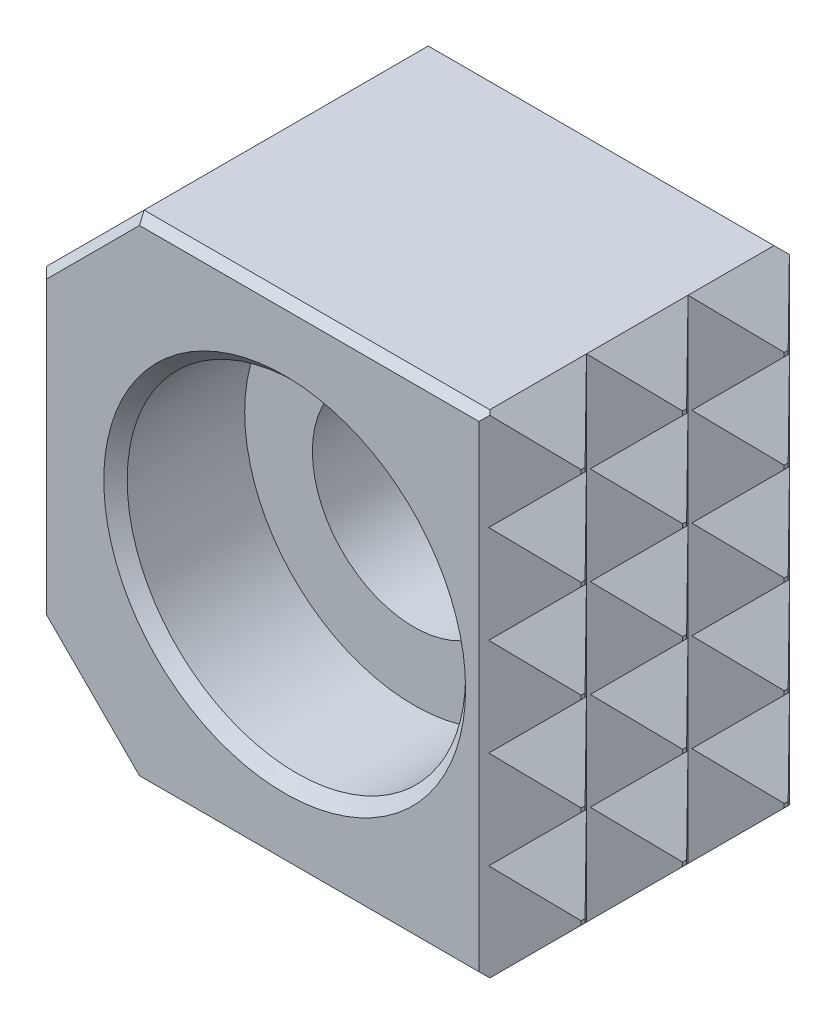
ISO-10303-21;
HEADER;
FILE_DESCRIPTION(('STEP AP214'),'2;1');
FILE_NAME('part.step','',(''),(''),'','','');
FILE_SCHEMA(('AUTOMOTIVE_DESIGN { 1 0 10303 214 1 1 1 1 }'));
ENDSEC;
DATA;
#1=APPLICATION_CONTEXT('core data for automotive mechanical design processes');
#2=APPLICATION_PROTOCOL_DEFINITION('international standard','automotive_design',2000,#1);
#3=PRODUCT_CONTEXT('',#1,'mechanical');
#4=PRODUCT('Part','Part','',(#3));
#5=PRODUCT_RELATED_PRODUCT_CATEGORY('part','',(#4));
#6=PRODUCT_DEFINITION_FORMATION('','',#4);
#7=PRODUCT_DEFINITION_CONTEXT('part definition',#1,'design');
#8=PRODUCT_DEFINITION('design','',#6,#7);
#9=PRODUCT_DEFINITION_SHAPE('','',#8);
#10=(LENGTH_UNIT() NAMED_UNIT(*) SI_UNIT(.MILLI.,.METRE.));
#11=(NAMED_UNIT(*) PLANE_ANGLE_UNIT() SI_UNIT($,.RADIAN.));
#12=(NAMED_UNIT(*) SI_UNIT($,.STERADIAN.) SOLID_ANGLE_UNIT());
#13=UNCERTAINTY_MEASURE_WITH_UNIT(LENGTH_MEASURE(1.E-05),#10,'distance_accuracy_value','');
#14=(GEOMETRIC_REPRESENTATION_CONTEXT(3) GLOBAL_UNCERTAINTY_ASSIGNED_CONTEXT((#13)) GLOBAL_UNIT_ASSIGNED_CONTEXT((#10,
#11,#12)) REPRESENTATION_CONTEXT('',''));
#15=CARTESIAN_POINT('',(0.,0.,0.));
#16=DIRECTION('',(0.,0.,1.));
#17=DIRECTION('',(1.,0.,0.));
#18=AXIS2_PLACEMENT_3D('',#15,#16,#17);
#19=CARTESIAN_POINT('',(8.,-8.,10.));
#20=DIRECTION('',(-1.,0.,0.));
#21=DIRECTION('',(0.,-1.,0.));
#22=AXIS2_PLACEMENT_3D('',#19,#20,#21);
#23=PLANE('',#22);
#24=DIRECTION('',(0.,-1.,0.));
#25=VECTOR('',#24,1.);
#26=CARTESIAN_POINT('',(8.,-8.,8.23602033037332));
#27=LINE('',#26,#25);
#28=CARTESIAN_POINT('',(8.,0.0634999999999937,8.23602033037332));
#29=VERTEX_POINT('',#28);
#30=CARTESIAN_POINT('',(8.,-0.0634999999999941,8.23602033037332));
#31=VERTEX_POINT('',#30);
#32=EDGE_CURVE('E772',#29,#31,#27,.T.);
#33=ORIENTED_EDGE('',*,*,#32,.F.);
#34=DIRECTION('',(0.,0.,-1.));
#35=VECTOR('',#34,1.);
#36=CARTESIAN_POINT('',(8.,0.0634999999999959,10.));
#37=LINE('',#36,#35);
#38=CARTESIAN_POINT('',(8.,0.0634999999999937,8.36307386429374));
#39=VERTEX_POINT('',#38);
#40=EDGE_CURVE('E462',#39,#29,#37,.T.);
#41=ORIENTED_EDGE('',*,*,#40,.F.);
#42=DIRECTION('',(0.,1.,0.));
#43=VECTOR('',#42,1.);
#44=CARTESIAN_POINT('',(8.,-8.,8.36307386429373));
#45=LINE('',#44,#43);
#46=CARTESIAN_POINT('',(8.,-0.0634999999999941,8.36307386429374));
#47=VERTEX_POINT('',#46);
#48=EDGE_CURVE('E737',#47,#39,#45,.T.);
#49=ORIENTED_EDGE('',*,*,#48,.F.);
#50=DIRECTION('',(0.,0.,-1.));
#51=VECTOR('',#50,1.);
#52=CARTESIAN_POINT('',(8.,-0.0634999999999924,10.));
#53=LINE('',#52,#51);
#54=EDGE_CURVE('E824',#47,#31,#53,.T.);
#55=ORIENTED_EDGE('',*,*,#54,.T.);
#56=EDGE_LOOP('',(#33,#41,#49,#55));
#57=FACE_BOUND('',#56,.T.);
#58=ADVANCED_FACE('F14',(#57),#23,.F.);
#59=CARTESIAN_POINT('',(8.,-0.0634999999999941,1.76029178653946));
#60=VERTEX_POINT('',#59);
#61=CARTESIAN_POINT('',(8.,-0.0634999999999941,1.63323825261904));
#62=VERTEX_POINT('',#61);
#63=EDGE_CURVE('E820',#60,#62,#53,.T.);
#64=ORIENTED_EDGE('',*,*,#63,.T.);
#65=DIRECTION('',(0.,1.,0.));
#66=VECTOR('',#65,1.);
#67=CARTESIAN_POINT('',(8.,-8.,1.63323825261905));
#68=LINE('',#67,#66);
#69=CARTESIAN_POINT('',(8.,0.0634999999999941,1.63323825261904));
#70=VERTEX_POINT('',#69);
#71=EDGE_CURVE('E697',#62,#70,#68,.T.);
#72=ORIENTED_EDGE('',*,*,#71,.T.);
#73=CARTESIAN_POINT('',(8.,0.0634999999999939,1.76029178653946));
#74=VERTEX_POINT('',#73);
#75=EDGE_CURVE('E458',#74,#70,#37,.T.);
#76=ORIENTED_EDGE('',*,*,#75,.F.);
#77=DIRECTION('',(0.,-1.,0.));
#78=VECTOR('',#77,1.);
#79=CARTESIAN_POINT('',(8.,-8.,1.76029178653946));
#80=LINE('',#79,#78);
#81=EDGE_CURVE('E666',#74,#60,#80,.T.);
#82=ORIENTED_EDGE('',*,*,#81,.T.);
#83=EDGE_LOOP('',(#64,#72,#76,#82));
#84=FACE_BOUND('',#83,.T.);
#85=ADVANCED_FACE('F873',(#84),#23,.F.);
#86=CARTESIAN_POINT('',(8.,-0.0634999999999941,5.0616828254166));
#87=VERTEX_POINT('',#86);
#88=CARTESIAN_POINT('',(8.,-0.0634999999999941,4.93462929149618));
#89=VERTEX_POINT('',#88);
#90=EDGE_CURVE('E823',#87,#89,#53,.T.);
#91=ORIENTED_EDGE('',*,*,#90,.T.);
#92=DIRECTION('',(0.,1.,0.));
#93=VECTOR('',#92,1.);
#94=CARTESIAN_POINT('',(8.,-8.,4.93462929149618));
#95=LINE('',#94,#93);
#96=CARTESIAN_POINT('',(8.,0.0634999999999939,4.93462929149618));
#97=VERTEX_POINT('',#96);
#98=EDGE_CURVE('E634',#89,#97,#95,.T.);
#99=ORIENTED_EDGE('',*,*,#98,.T.);
#100=CARTESIAN_POINT('',(8.,0.0634999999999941,5.0616828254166));
#101=VERTEX_POINT('',#100);
#102=EDGE_CURVE('E461',#101,#97,#37,.T.);
#103=ORIENTED_EDGE('',*,*,#102,.F.);
#104=DIRECTION('',(0.,1.,0.));
#105=VECTOR('',#104,1.);
#106=CARTESIAN_POINT('',(8.,-8.,5.0616828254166));
#107=LINE('',#106,#105);
#108=EDGE_CURVE('E603',#87,#101,#107,.T.);
#109=ORIENTED_EDGE('',*,*,#108,.F.);
#110=EDGE_LOOP('',(#91,#99,#103,#109));
#111=FACE_BOUND('',#110,.T.);
#112=ADVANCED_FACE('F936',(#111),#23,.F.);
#113=DIRECTION('',(0.,-1.,0.));
#114=VECTOR('',#113,1.);
#115=CARTESIAN_POINT('',(8.,-8.,8.23602033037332));
#116=LINE('',#115,#114);
#117=CARTESIAN_POINT('',(8.,3.2385,8.23602033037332));
#118=VERTEX_POINT('',#117);
#119=CARTESIAN_POINT('',(8.,3.1115,8.23602033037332));
#120=VERTEX_POINT('',#119);
#121=EDGE_CURVE('E770',#118,#120,#116,.T.);
#122=ORIENTED_EDGE('',*,*,#121,.F.);
#123=DIRECTION('',(0.,0.,-1.));
#124=VECTOR('',#123,1.);
#125=CARTESIAN_POINT('',(8.,3.2385,10.));
#126=LINE('',#125,#124);
#127=CARTESIAN_POINT('',(8.,3.2385,8.36307386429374));
#128=VERTEX_POINT('',#127);
#129=EDGE_CURVE('E452',#128,#118,#126,.T.);
#130=ORIENTED_EDGE('',*,*,#129,.F.);
#131=DIRECTION('',(0.,1.,0.));
#132=VECTOR('',#131,1.);
#133=CARTESIAN_POINT('',(8.,-8.,8.36307386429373));
#134=LINE('',#133,#132);
#135=CARTESIAN_POINT('',(8.,3.1115,8.36307386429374));
#136=VERTEX_POINT('',#135);
#137=EDGE_CURVE('E735',#136,#128,#134,.T.);
#138=ORIENTED_EDGE('',*,*,#137,.F.);
#139=DIRECTION('',(0.,0.,1.));
#140=VECTOR('',#139,1.);
#141=CARTESIAN_POINT('',(8.,3.1115,10.));
#142=LINE('',#141,#140);
#143=EDGE_CURVE('E453',#120,#136,#142,.T.);
#144=ORIENTED_EDGE('',*,*,#143,.F.);
#145=EDGE_LOOP('',(#122,#130,#138,#144));
#146=FACE_BOUND('',#145,.T.);
#147=ADVANCED_FACE('F913',(#146),#23,.F.);
#148=CARTESIAN_POINT('',(8.,3.1115,1.63323825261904));
#149=VERTEX_POINT('',#148);
#150=CARTESIAN_POINT('',(8.,3.1115,1.76029178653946));
#151=VERTEX_POINT('',#150);
#152=EDGE_CURVE('E457',#149,#151,#142,.T.);
#153=ORIENTED_EDGE('',*,*,#152,.F.);
#154=DIRECTION('',(0.,1.,0.));
#155=VECTOR('',#154,1.);
#156=CARTESIAN_POINT('',(8.,-8.,1.63323825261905));
#157=LINE('',#156,#155);
#158=CARTESIAN_POINT('',(8.,3.2385,1.63323825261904));
#159=VERTEX_POINT('',#158);
#160=EDGE_CURVE('E694',#149,#159,#157,.T.);
#161=ORIENTED_EDGE('',*,*,#160,.T.);
#162=CARTESIAN_POINT('',(8.,3.2385,1.76029178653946));
#163=VERTEX_POINT('',#162);
#164=EDGE_CURVE('E448',#163,#159,#126,.T.);
#165=ORIENTED_EDGE('',*,*,#164,.F.);
#166=DIRECTION('',(0.,-1.,0.));
#167=VECTOR('',#166,1.);
#168=CARTESIAN_POINT('',(8.,-8.,1.76029178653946));
#169=LINE('',#168,#167);
#170=EDGE_CURVE('E663',#163,#151,#169,.T.);
#171=ORIENTED_EDGE('',*,*,#170,.T.);
#172=EDGE_LOOP('',(#153,#161,#165,#171));
#173=FACE_BOUND('',#172,.T.);
#174=ADVANCED_FACE('F1126',(#173),#23,.F.);
#175=CARTESIAN_POINT('',(8.,3.1115,4.93462929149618));
#176=VERTEX_POINT('',#175);
#177=CARTESIAN_POINT('',(8.,3.1115,5.0616828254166));
#178=VERTEX_POINT('',#177);
#179=EDGE_CURVE('E456',#176,#178,#142,.T.);
#180=ORIENTED_EDGE('',*,*,#179,.F.);
#181=DIRECTION('',(0.,1.,0.));
#182=VECTOR('',#181,1.);
#183=CARTESIAN_POINT('',(8.,-8.,4.93462929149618));
#184=LINE('',#183,#182);
#185=CARTESIAN_POINT('',(8.,3.2385,4.93462929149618));
#186=VERTEX_POINT('',#185);
#187=EDGE_CURVE('E631',#176,#186,#184,.T.);
#188=ORIENTED_EDGE('',*,*,#187,.T.);
#189=CARTESIAN_POINT('',(8.,3.2385,5.0616828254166));
#190=VERTEX_POINT('',#189);
#191=EDGE_CURVE('E451',#190,#186,#126,.T.);
#192=ORIENTED_EDGE('',*,*,#191,.F.);
#193=DIRECTION('',(0.,1.,0.));
#194=VECTOR('',#193,1.);
#195=CARTESIAN_POINT('',(8.,-8.,5.0616828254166));
#196=LINE('',#195,#194);
#197=EDGE_CURVE('E601',#178,#190,#196,.T.);
#198=ORIENTED_EDGE('',*,*,#197,.F.);
#199=EDGE_LOOP('',(#180,#188,#192,#198));
#200=FACE_BOUND('',#199,.T.);
#201=ADVANCED_FACE('F901',(#200),#23,.F.);
#202=DIRECTION('',(0.,-1.,0.));
#203=VECTOR('',#202,1.);
#204=CARTESIAN_POINT('',(8.,-8.,8.23602033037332));
#205=LINE('',#204,#203);
#206=CARTESIAN_POINT('',(8.,6.4135,8.23602033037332));
#207=VERTEX_POINT('',#206);
#208=CARTESIAN_POINT('',(8.,6.2865,8.23602033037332));
#209=VERTEX_POINT('',#208);
#210=EDGE_CURVE('E782',#207,#209,#205,.T.);
#211=ORIENTED_EDGE('',*,*,#210,.F.);
#212=DIRECTION('',(0.,0.,-1.));
#213=VECTOR('',#212,1.);
#214=CARTESIAN_POINT('',(8.,6.4135,10.));
#215=LINE('',#214,#213);
#216=CARTESIAN_POINT('',(8.,6.4135,8.36307386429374));
#217=VERTEX_POINT('',#216);
#218=EDGE_CURVE('E442',#217,#207,#215,.T.);
#219=ORIENTED_EDGE('',*,*,#218,.F.);
#220=DIRECTION('',(0.,1.,0.));
#221=VECTOR('',#220,1.);
#222=CARTESIAN_POINT('',(8.,-8.,8.36307386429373));
#223=LINE('',#222,#221);
#224=CARTESIAN_POINT('',(8.,6.2865,8.36307386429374));
#225=VERTEX_POINT('',#224);
#226=EDGE_CURVE('E747',#225,#217,#223,.T.);
#227=ORIENTED_EDGE('',*,*,#226,.F.);
#228=DIRECTION('',(0.,0.,1.));
#229=VECTOR('',#228,1.);
#230=CARTESIAN_POINT('',(8.,6.2865,10.));
#231=LINE('',#230,#229);
#232=EDGE_CURVE('E443',#209,#225,#231,.T.);
#233=ORIENTED_EDGE('',*,*,#232,.F.);
#234=EDGE_LOOP('',(#211,#219,#227,#233));
#235=FACE_BOUND('',#234,.T.);
#236=ADVANCED_FACE('F992',(#235),#23,.F.);
#237=CARTESIAN_POINT('',(8.,6.2865,1.63323825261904));
#238=VERTEX_POINT('',#237);
#239=CARTESIAN_POINT('',(8.,6.2865,1.76029178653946));
#240=VERTEX_POINT('',#239);
#241=EDGE_CURVE('E447',#238,#240,#231,.T.);
#242=ORIENTED_EDGE('',*,*,#241,.F.);
#243=DIRECTION('',(0.,1.,0.));
#244=VECTOR('',#243,1.);
#245=CARTESIAN_POINT('',(8.,-8.,1.63323825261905));
#246=LINE('',#245,#244);
#247=CARTESIAN_POINT('',(8.,6.4135,1.63323825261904));
#248=VERTEX_POINT('',#247);
#249=EDGE_CURVE('E707',#238,#248,#246,.T.);
#250=ORIENTED_EDGE('',*,*,#249,.T.);
#251=CARTESIAN_POINT('',(8.,6.4135,1.76029178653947));
#252=VERTEX_POINT('',#251);
#253=EDGE_CURVE('E438',#252,#248,#215,.T.);
#254=ORIENTED_EDGE('',*,*,#253,.F.);
#255=DIRECTION('',(0.,-1.,0.));
#256=VECTOR('',#255,1.);
#257=CARTESIAN_POINT('',(8.,-8.,1.76029178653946));
#258=LINE('',#257,#256);
#259=EDGE_CURVE('E676',#252,#240,#258,.T.);
#260=ORIENTED_EDGE('',*,*,#259,.T.);
#261=EDGE_LOOP('',(#242,#250,#254,#260));
#262=FACE_BOUND('',#261,.T.);
#263=ADVANCED_FACE('F1095',(#262),#23,.F.);
#264=CARTESIAN_POINT('',(8.,6.2865,4.93462929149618));
#265=VERTEX_POINT('',#264);
#266=CARTESIAN_POINT('',(8.,6.2865,5.0616828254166));
#267=VERTEX_POINT('',#266);
#268=EDGE_CURVE('E446',#265,#267,#231,.T.);
#269=ORIENTED_EDGE('',*,*,#268,.F.);
#270=DIRECTION('',(0.,1.,0.));
#271=VECTOR('',#270,1.);
#272=CARTESIAN_POINT('',(8.,-8.,4.93462929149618));
#273=LINE('',#272,#271);
#274=CARTESIAN_POINT('',(8.,6.4135,4.93462929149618));
#275=VERTEX_POINT('',#274);
#276=EDGE_CURVE('E644',#265,#275,#273,.T.);
#277=ORIENTED_EDGE('',*,*,#276,.T.);
#278=CARTESIAN_POINT('',(8.,6.4135,5.0616828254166));
#279=VERTEX_POINT('',#278);
#280=EDGE_CURVE('E441',#279,#275,#215,.T.);
#281=ORIENTED_EDGE('',*,*,#280,.F.);
#282=DIRECTION('',(0.,1.,0.));
#283=VECTOR('',#282,1.);
#284=CARTESIAN_POINT('',(8.,-8.,5.0616828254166));
#285=LINE('',#284,#283);
#286=EDGE_CURVE('E613',#267,#279,#285,.T.);
#287=ORIENTED_EDGE('',*,*,#286,.F.);
#288=EDGE_LOOP('',(#269,#277,#281,#287));
#289=FACE_BOUND('',#288,.T.);
#290=ADVANCED_FACE('F982',(#289),#23,.F.);
#291=DIRECTION('',(0.,-1.,0.));
#292=VECTOR('',#291,1.);
#293=CARTESIAN_POINT('',(8.,-8.,8.23602033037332));
#294=LINE('',#293,#292);
#295=CARTESIAN_POINT('',(8.,-6.2865,8.23602033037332));
#296=VERTEX_POINT('',#295);
#297=CARTESIAN_POINT('',(8.,-6.4135,8.23602033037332));
#298=VERTEX_POINT('',#297);
#299=EDGE_CURVE('E795',#296,#298,#294,.T.);
#300=ORIENTED_EDGE('',*,*,#299,.F.);
#301=DIRECTION('',(0.,0.,1.));
#302=VECTOR('',#301,1.);
#303=CARTESIAN_POINT('',(8.,-6.2865,10.));
#304=LINE('',#303,#302);
#305=CARTESIAN_POINT('',(8.,-6.2865,8.36307386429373));
#306=VERTEX_POINT('',#305);
#307=EDGE_CURVE('E428',#296,#306,#304,.T.);
#308=ORIENTED_EDGE('',*,*,#307,.T.);
#309=DIRECTION('',(0.,1.,0.));
#310=VECTOR('',#309,1.);
#311=CARTESIAN_POINT('',(8.,-8.,8.36307386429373));
#312=LINE('',#311,#310);
#313=CARTESIAN_POINT('',(8.,-6.4135,8.36307386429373));
#314=VERTEX_POINT('',#313);
#315=EDGE_CURVE('E760',#314,#306,#312,.T.);
#316=ORIENTED_EDGE('',*,*,#315,.F.);
#317=DIRECTION('',(0.,0.,-1.));
#318=VECTOR('',#317,1.);
#319=CARTESIAN_POINT('',(8.,-6.4135,10.));
#320=LINE('',#319,#318);
#321=EDGE_CURVE('E432',#314,#298,#320,.T.);
#322=ORIENTED_EDGE('',*,*,#321,.T.);
#323=EDGE_LOOP('',(#300,#308,#316,#322));
#324=FACE_BOUND('',#323,.T.);
#325=ADVANCED_FACE('F965',(#324),#23,.F.);
#326=CARTESIAN_POINT('',(8.,-6.4135,1.76029178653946));
#327=VERTEX_POINT('',#326);
#328=CARTESIAN_POINT('',(8.,-6.4135,1.63323825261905));
#329=VERTEX_POINT('',#328);
#330=EDGE_CURVE('E409',#327,#329,#320,.T.);
#331=ORIENTED_EDGE('',*,*,#330,.T.);
#332=DIRECTION('',(0.,1.,0.));
#333=VECTOR('',#332,1.);
#334=CARTESIAN_POINT('',(8.,-8.,1.63323825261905));
#335=LINE('',#334,#333);
#336=CARTESIAN_POINT('',(8.,-6.2865,1.63323825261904));
#337=VERTEX_POINT('',#336);
#338=EDGE_CURVE('E726',#329,#337,#335,.T.);
#339=ORIENTED_EDGE('',*,*,#338,.T.);
#340=CARTESIAN_POINT('',(8.,-6.2865,1.76029178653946));
#341=VERTEX_POINT('',#340);
#342=EDGE_CURVE('E420',#337,#341,#304,.T.);
#343=ORIENTED_EDGE('',*,*,#342,.T.);
#344=DIRECTION('',(0.,-1.,0.));
#345=VECTOR('',#344,1.);
#346=CARTESIAN_POINT('',(8.,-8.,1.76029178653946));
#347=LINE('',#346,#345);
#348=EDGE_CURVE('E411',#341,#327,#347,.T.);
#349=ORIENTED_EDGE('',*,*,#348,.T.);
#350=EDGE_LOOP('',(#331,#339,#343,#349));
#351=FACE_BOUND('',#350,.T.);
#352=ADVANCED_FACE('F852',(#351),#23,.F.);
#353=CARTESIAN_POINT('',(8.,-6.4135,5.0616828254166));
#354=VERTEX_POINT('',#353);
#355=CARTESIAN_POINT('',(8.,-6.4135,4.93462929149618));
#356=VERTEX_POINT('',#355);
#357=EDGE_CURVE('E431',#354,#356,#320,.T.);
#358=ORIENTED_EDGE('',*,*,#357,.T.);
#359=DIRECTION('',(0.,1.,0.));
#360=VECTOR('',#359,1.);
#361=CARTESIAN_POINT('',(8.,-8.,4.93462929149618));
#362=LINE('',#361,#360);
#363=CARTESIAN_POINT('',(8.,-6.2865,4.93462929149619));
#364=VERTEX_POINT('',#363);
#365=EDGE_CURVE('E384',#356,#364,#362,.T.);
#366=ORIENTED_EDGE('',*,*,#365,.T.);
#367=CARTESIAN_POINT('',(8.,-6.2865,5.0616828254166));
#368=VERTEX_POINT('',#367);
#369=EDGE_CURVE('E843',#364,#368,#304,.T.);
#370=ORIENTED_EDGE('',*,*,#369,.T.);
#371=DIRECTION('',(0.,1.,0.));
#372=VECTOR('',#371,1.);
#373=CARTESIAN_POINT('',(8.,-8.,5.0616828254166));
#374=LINE('',#373,#372);
#375=EDGE_CURVE('E626',#354,#368,#374,.T.);
#376=ORIENTED_EDGE('',*,*,#375,.F.);
#377=EDGE_LOOP('',(#358,#366,#370,#376));
#378=FACE_BOUND('',#377,.T.);
#379=ADVANCED_FACE('F961',(#378),#23,.F.);
#380=DIRECTION('',(0.,-1.,0.));
#381=VECTOR('',#380,1.);
#382=CARTESIAN_POINT('',(8.,-8.,8.23602033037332));
#383=LINE('',#382,#381);
#384=CARTESIAN_POINT('',(8.,-3.1115,8.23602033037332));
#385=VERTEX_POINT('',#384);
#386=CARTESIAN_POINT('',(8.,-3.2385,8.23602033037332));
#387=VERTEX_POINT('',#386);
#388=EDGE_CURVE('E789',#385,#387,#383,.T.);
#389=ORIENTED_EDGE('',*,*,#388,.F.);
#390=DIRECTION('',(0.,0.,1.));
#391=VECTOR('',#390,1.);
#392=CARTESIAN_POINT('',(8.,-3.1115,10.));
#393=LINE('',#392,#391);
#394=CARTESIAN_POINT('',(8.,-3.1115,8.36307386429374));
#395=VERTEX_POINT('',#394);
#396=EDGE_CURVE('E825',#385,#395,#393,.T.);
#397=ORIENTED_EDGE('',*,*,#396,.T.);
#398=DIRECTION('',(0.,1.,0.));
#399=VECTOR('',#398,1.);
#400=CARTESIAN_POINT('',(8.,-8.,8.36307386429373));
#401=LINE('',#400,#399);
#402=CARTESIAN_POINT('',(8.,-3.2385,8.36307386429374));
#403=VERTEX_POINT('',#402);
#404=EDGE_CURVE('E754',#403,#395,#401,.T.);
#405=ORIENTED_EDGE('',*,*,#404,.F.);
#406=DIRECTION('',(0.,0.,-1.));
#407=VECTOR('',#406,1.);
#408=CARTESIAN_POINT('',(8.,-3.2385,10.));
#409=LINE('',#408,#407);
#410=EDGE_CURVE('E832',#403,#387,#409,.T.);
#411=ORIENTED_EDGE('',*,*,#410,.T.);
#412=EDGE_LOOP('',(#389,#397,#405,#411));
#413=FACE_BOUND('',#412,.T.);
#414=ADVANCED_FACE('F1006',(#413),#23,.F.);
#415=CARTESIAN_POINT('',(8.,-3.2385,1.76029178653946));
#416=VERTEX_POINT('',#415);
#417=CARTESIAN_POINT('',(8.,-3.2385,1.63323825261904));
#418=VERTEX_POINT('',#417);
#419=EDGE_CURVE('E829',#416,#418,#409,.T.);
#420=ORIENTED_EDGE('',*,*,#419,.T.);
#421=DIRECTION('',(0.,1.,0.));
#422=VECTOR('',#421,1.);
#423=CARTESIAN_POINT('',(8.,-8.,1.63323825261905));
#424=LINE('',#423,#422);
#425=CARTESIAN_POINT('',(8.,-3.1115,1.63323825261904));
#426=VERTEX_POINT('',#425);
#427=EDGE_CURVE('E718',#418,#426,#424,.T.);
#428=ORIENTED_EDGE('',*,*,#427,.T.);
#429=CARTESIAN_POINT('',(8.,-3.1115,1.76029178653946));
#430=VERTEX_POINT('',#429);
#431=EDGE_CURVE('E828',#426,#430,#393,.T.);
#432=ORIENTED_EDGE('',*,*,#431,.T.);
#433=DIRECTION('',(0.,-1.,0.));
#434=VECTOR('',#433,1.);
#435=CARTESIAN_POINT('',(8.,-8.,1.76029178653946));
#436=LINE('',#435,#434);
#437=EDGE_CURVE('E683',#430,#416,#436,.T.);
#438=ORIENTED_EDGE('',*,*,#437,.T.);
#439=EDGE_LOOP('',(#420,#428,#432,#438));
#440=FACE_BOUND('',#439,.T.);
#441=ADVANCED_FACE('F864',(#440),#23,.F.);
#442=CARTESIAN_POINT('',(8.,-3.2385,5.0616828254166));
#443=VERTEX_POINT('',#442);
#444=CARTESIAN_POINT('',(8.,-3.2385,4.93462929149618));
#445=VERTEX_POINT('',#444);
#446=EDGE_CURVE('E831',#443,#445,#409,.T.);
#447=ORIENTED_EDGE('',*,*,#446,.T.);
#448=DIRECTION('',(0.,1.,0.));
#449=VECTOR('',#448,1.);
#450=CARTESIAN_POINT('',(8.,-8.,4.93462929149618));
#451=LINE('',#450,#449);
#452=CARTESIAN_POINT('',(8.,-3.1115,4.93462929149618));
#453=VERTEX_POINT('',#452);
#454=EDGE_CURVE('E652',#445,#453,#451,.T.);
#455=ORIENTED_EDGE('',*,*,#454,.T.);
#456=CARTESIAN_POINT('',(8.,-3.1115,5.0616828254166));
#457=VERTEX_POINT('',#456);
#458=EDGE_CURVE('E827',#453,#457,#393,.T.);
#459=ORIENTED_EDGE('',*,*,#458,.T.);
#460=DIRECTION('',(0.,1.,0.));
#461=VECTOR('',#460,1.);
#462=CARTESIAN_POINT('',(8.,-8.,5.0616828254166));
#463=LINE('',#462,#461);
#464=EDGE_CURVE('E620',#443,#457,#463,.T.);
#465=ORIENTED_EDGE('',*,*,#464,.F.);
#466=EDGE_LOOP('',(#447,#455,#459,#465));
#467=FACE_BOUND('',#466,.T.);
#468=ADVANCED_FACE('F949',(#467),#23,.F.);
#469=CARTESIAN_POINT('',(-8.,8.,10.));
#470=DIRECTION('',(0.,1.,0.));
#471=DIRECTION('',(-1.,0.,0.));
#472=AXIS2_PLACEMENT_3D('',#469,#470,#471);
#473=PLANE('',#472);
#474=DIRECTION('',(0.,0.,1.));
#475=VECTOR('',#474,1.);
#476=CARTESIAN_POINT('',(-4.825,8.,10.));
#477=LINE('',#476,#475);
#478=CARTESIAN_POINT('',(-4.825,8.,0.508));
#479=VERTEX_POINT('',#478);
#480=CARTESIAN_POINT('',(-4.825,8.,9.746));
#481=VERTEX_POINT('',#480);
#482=EDGE_CURVE('E476',#479,#481,#477,.T.);
#483=ORIENTED_EDGE('',*,*,#482,.T.);
#484=DIRECTION('',(1.,0.,0.));
#485=VECTOR('',#484,1.);
#486=CARTESIAN_POINT('',(6.31485005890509,8.,9.746));
#487=LINE('',#486,#485);
#488=CARTESIAN_POINT('',(6.41349999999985,8.,9.746));
#489=VERTEX_POINT('',#488);
#490=EDGE_CURVE('E21',#481,#489,#487,.T.);
#491=ORIENTED_EDGE('',*,*,#490,.T.);
#492=DIRECTION('',(0.,0.,-1.));
#493=VECTOR('',#492,1.);
#494=CARTESIAN_POINT('',(6.41349999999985,8.,10.));
#495=LINE('',#494,#493);
#496=CARTESIAN_POINT('',(6.41349999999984,8.,6.60278207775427));
#497=VERTEX_POINT('',#496);
#498=EDGE_CURVE('E437',#489,#497,#495,.T.);
#499=ORIENTED_EDGE('',*,*,#498,.T.);
#500=CARTESIAN_POINT('',(6.41349999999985,8.,3.30139103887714));
#501=VERTEX_POINT('',#500);
#502=EDGE_CURVE('E436',#497,#501,#495,.T.);
#503=ORIENTED_EDGE('',*,*,#502,.T.);
#504=CARTESIAN_POINT('',(6.41349999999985,8.,0.508));
#505=VERTEX_POINT('',#504);
#506=EDGE_CURVE('E433',#501,#505,#495,.T.);
#507=ORIENTED_EDGE('',*,*,#506,.T.);
#508=DIRECTION('',(-1.,0.,0.));
#509=VECTOR('',#508,1.);
#510=CARTESIAN_POINT('',(-8.,8.,0.508));
#511=LINE('',#510,#509);
#512=EDGE_CURVE('E533',#505,#479,#511,.T.);
#513=ORIENTED_EDGE('',*,*,#512,.T.);
#514=EDGE_LOOP('',(#483,#491,#499,#503,#507,#513));
#515=FACE_BOUND('',#514,.T.);
#516=ADVANCED_FACE('F1051',(#515),#473,.T.);
#517=CARTESIAN_POINT('',(8.,8.,10.));
#518=DIRECTION('',(0.,0.,-1.));
#519=DIRECTION('',(1.,0.,0.));
#520=AXIS2_PLACEMENT_3D('',#517,#518,#519);
#521=PLANE('',#520);
#522=CARTESIAN_POINT('',(0.,0.,10.));
#523=DIRECTION('',(0.,0.,-1.));
#524=DIRECTION('',(1.,0.,0.));
#525=AXIS2_PLACEMENT_3D('',#522,#523,#524);
#526=CIRCLE('',#525,5.881);
#527=CARTESIAN_POINT('',(5.881,0.,10.));
#528=VERTEX_POINT('',#527);
#529=EDGE_CURVE('E496',#528,#528,#526,.T.);
#530=ORIENTED_EDGE('',*,*,#529,.T.);
#531=EDGE_LOOP('',(#530));
#532=FACE_BOUND('',#531,.T.);
#533=DIRECTION('',(0.707106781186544,-0.707106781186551,0.));
#534=VECTOR('',#533,1.);
#535=CARTESIAN_POINT('',(-4.64539487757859,-7.82039487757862,10.));
#536=LINE('',#535,#534);
#537=CARTESIAN_POINT('',(-7.746,-4.71978975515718,10.));
#538=VERTEX_POINT('',#537);
#539=CARTESIAN_POINT('',(-4.71978975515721,-7.746,10.));
#540=VERTEX_POINT('',#539);
#541=EDGE_CURVE('E544',#538,#540,#536,.T.);
#542=ORIENTED_EDGE('',*,*,#541,.T.);
#543=DIRECTION('',(1.,0.,0.));
#544=VECTOR('',#543,1.);
#545=CARTESIAN_POINT('',(6.31485005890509,-7.746,10.));
#546=LINE('',#545,#544);
#547=CARTESIAN_POINT('',(6.31485005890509,-7.746,10.));
#548=VERTEX_POINT('',#547);
#549=EDGE_CURVE('E546',#540,#548,#546,.T.);
#550=ORIENTED_EDGE('',*,*,#549,.T.);
#551=DIRECTION('',(0.,-1.,0.));
#552=VECTOR('',#551,1.);
#553=CARTESIAN_POINT('',(6.31485005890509,8.,10.));
#554=LINE('',#553,#552);
#555=CARTESIAN_POINT('',(6.31485005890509,7.746,10.));
#556=VERTEX_POINT('',#555);
#557=EDGE_CURVE('E764',#556,#548,#554,.T.);
#558=ORIENTED_EDGE('',*,*,#557,.F.);
#559=DIRECTION('',(-1.,0.,0.));
#560=VECTOR('',#559,1.);
#561=CARTESIAN_POINT('',(-4.825,7.746,10.));
#562=LINE('',#561,#560);
#563=CARTESIAN_POINT('',(-4.71978975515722,7.746,10.));
#564=VERTEX_POINT('',#563);
#565=EDGE_CURVE('E538',#556,#564,#562,.T.);
#566=ORIENTED_EDGE('',*,*,#565,.T.);
#567=DIRECTION('',(-0.707106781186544,-0.707106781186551,0.));
#568=VECTOR('',#567,1.);
#569=CARTESIAN_POINT('',(-7.82039487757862,4.64539487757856,10.));
#570=LINE('',#569,#568);
#571=CARTESIAN_POINT('',(-7.746,4.71978975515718,10.));
#572=VERTEX_POINT('',#571);
#573=EDGE_CURVE('E540',#564,#572,#570,.T.);
#574=ORIENTED_EDGE('',*,*,#573,.T.);
#575=DIRECTION('',(0.,-1.,0.));
#576=VECTOR('',#575,1.);
#577=CARTESIAN_POINT('',(-7.746,8.,10.));
#578=LINE('',#577,#576);
#579=EDGE_CURVE('E542',#572,#538,#578,.T.);
#580=ORIENTED_EDGE('',*,*,#579,.T.);
#581=EDGE_LOOP('',(#542,#550,#558,#566,#574,#580));
#582=FACE_BOUND('',#581,.T.);
#583=ADVANCED_FACE('F1058',(#532,#582),#521,.F.);
#584=CARTESIAN_POINT('',(8.,-8.,10.));
#585=DIRECTION('',(0.,-1.,0.));
#586=DIRECTION('',(1.,0.,0.));
#587=AXIS2_PLACEMENT_3D('',#584,#585,#586);
#588=PLANE('',#587);
#589=DIRECTION('',(0.,0.,-1.));
#590=VECTOR('',#589,1.);
#591=CARTESIAN_POINT('',(6.41349999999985,-8.,10.));
#592=LINE('',#591,#590);
#593=CARTESIAN_POINT('',(6.41349999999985,-8.,9.746));
#594=VERTEX_POINT('',#593);
#595=CARTESIAN_POINT('',(6.41349999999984,-8.,6.60278207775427));
#596=VERTEX_POINT('',#595);
#597=EDGE_CURVE('E422',#594,#596,#592,.T.);
#598=ORIENTED_EDGE('',*,*,#597,.F.);
#599=DIRECTION('',(-1.,0.,0.));
#600=VECTOR('',#599,1.);
#601=CARTESIAN_POINT('',(-4.825,-8.,9.746));
#602=LINE('',#601,#600);
#603=CARTESIAN_POINT('',(-4.825,-8.,9.746));
#604=VERTEX_POINT('',#603);
#605=EDGE_CURVE('E535',#594,#604,#602,.T.);
#606=ORIENTED_EDGE('',*,*,#605,.T.);
#607=DIRECTION('',(0.,0.,-1.));
#608=VECTOR('',#607,1.);
#609=CARTESIAN_POINT('',(-4.825,-8.,0.));
#610=LINE('',#609,#608);
#611=CARTESIAN_POINT('',(-4.825,-8.,0.508));
#612=VERTEX_POINT('',#611);
#613=EDGE_CURVE('E469',#604,#612,#610,.T.);
#614=ORIENTED_EDGE('',*,*,#613,.T.);
#615=DIRECTION('',(1.,0.,0.));
#616=VECTOR('',#615,1.);
#617=CARTESIAN_POINT('',(8.,-8.,0.508));
#618=LINE('',#617,#616);
#619=CARTESIAN_POINT('',(6.41349999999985,-8.,0.508));
#620=VERTEX_POINT('',#619);
#621=EDGE_CURVE('E419',#612,#620,#618,.T.);
#622=ORIENTED_EDGE('',*,*,#621,.T.);
#623=CARTESIAN_POINT('',(6.41349999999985,-8.,3.30139103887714));
#624=VERTEX_POINT('',#623);
#625=EDGE_CURVE('E406',#624,#620,#592,.T.);
#626=ORIENTED_EDGE('',*,*,#625,.F.);
#627=EDGE_CURVE('E417',#596,#624,#592,.T.);
#628=ORIENTED_EDGE('',*,*,#627,.F.);
#629=EDGE_LOOP('',(#598,#606,#614,#622,#626,#628));
#630=FACE_BOUND('',#629,.T.);
#631=ADVANCED_FACE('F416',(#630),#588,.T.);
#632=CARTESIAN_POINT('',(8.0635,0.,0.));
#633=DIRECTION('',(-0.707106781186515,0.70710678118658,0.));
#634=DIRECTION('',(-0.70710678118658,-0.707106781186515,0.));
#635=AXIS2_PLACEMENT_3D('',#632,#633,#634);
#636=PLANE('',#635);
#637=DIRECTION('',(-0.571681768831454,-0.571681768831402,-0.588523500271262));
#638=VECTOR('',#637,1.);
#639=CARTESIAN_POINT('',(5.27051229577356,-2.79298770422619,5.42612198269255));
#640=LINE('',#639,#638);
#641=CARTESIAN_POINT('',(6.476,-1.58749999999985,6.66712332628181));
#642=VERTEX_POINT('',#641);
#643=EDGE_CURVE('E780',#31,#642,#640,.T.);
#644=ORIENTED_EDGE('',*,*,#643,.F.);
#645=ORIENTED_EDGE('',*,*,#54,.F.);
#646=DIRECTION('',(0.582856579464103,0.58285657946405,-0.566177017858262));
#647=VECTOR('',#646,1.);
#648=CARTESIAN_POINT('',(10.8029590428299,2.73945904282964,5.64032688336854));
#649=LINE('',#648,#647);
#650=CARTESIAN_POINT('',(6.476,-1.58749999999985,9.84346167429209));
#651=VERTEX_POINT('',#650);
#652=EDGE_CURVE('E745',#651,#47,#649,.T.);
#653=ORIENTED_EDGE('',*,*,#652,.F.);
#654=DIRECTION('',(0.,0.,1.));
#655=VECTOR('',#654,1.);
#656=CARTESIAN_POINT('',(6.476,-1.58749999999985,0.));
#657=LINE('',#656,#655);
#658=EDGE_CURVE('E800',#642,#651,#657,.T.);
#659=ORIENTED_EDGE('',*,*,#658,.F.);
#660=EDGE_LOOP('',(#644,#645,#653,#659));
#661=FACE_BOUND('',#660,.T.);
#662=ADVANCED_FACE('F1000',(#661),#636,.F.);
#663=CARTESIAN_POINT('',(6.476,-1.58749999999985,0.0643412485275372));
#664=VERTEX_POINT('',#663);
#665=CARTESIAN_POINT('',(6.476,-1.58749999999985,3.24067959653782));
#666=VERTEX_POINT('',#665);
#667=EDGE_CURVE('E804',#664,#666,#657,.T.);
#668=ORIENTED_EDGE('',*,*,#667,.F.);
#669=DIRECTION('',(0.571681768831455,0.571681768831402,0.588523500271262));
#670=VECTOR('',#669,1.);
#671=CARTESIAN_POINT('',(7.49200614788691,-0.571493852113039,1.11027891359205));
#672=LINE('',#671,#670);
#673=EDGE_CURVE('E704',#664,#62,#672,.T.);
#674=ORIENTED_EDGE('',*,*,#673,.T.);
#675=ORIENTED_EDGE('',*,*,#63,.F.);
#676=DIRECTION('',(-0.582856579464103,-0.58285657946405,0.566177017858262));
#677=VECTOR('',#676,1.);
#678=CARTESIAN_POINT('',(8.62404095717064,0.560540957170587,1.15410896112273));
#679=LINE('',#678,#677);
#680=EDGE_CURVE('E673',#60,#666,#679,.T.);
#681=ORIENTED_EDGE('',*,*,#680,.T.);
#682=EDGE_LOOP('',(#668,#674,#675,#681));
#683=FACE_BOUND('',#682,.T.);
#684=ADVANCED_FACE('F871',(#683),#636,.F.);
#685=CARTESIAN_POINT('',(6.476,-1.58749999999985,3.36573228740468));
#686=VERTEX_POINT('',#685);
#687=CARTESIAN_POINT('',(6.476,-1.58749999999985,6.54207063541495));
#688=VERTEX_POINT('',#687);
#689=EDGE_CURVE('E803',#686,#688,#657,.T.);
#690=ORIENTED_EDGE('',*,*,#689,.F.);
#691=DIRECTION('',(0.571681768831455,0.571681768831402,0.588523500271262));
#692=VECTOR('',#691,1.);
#693=CARTESIAN_POINT('',(6.38125922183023,-1.68224077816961,3.26820044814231));
#694=LINE('',#693,#692);
#695=EDGE_CURVE('E641',#686,#89,#694,.T.);
#696=ORIENTED_EDGE('',*,*,#695,.T.);
#697=ORIENTED_EDGE('',*,*,#90,.F.);
#698=DIRECTION('',(0.582856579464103,0.58285657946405,-0.566177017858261));
#699=VECTOR('',#698,1.);
#700=CARTESIAN_POINT('',(9.71350000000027,1.65000000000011,3.39721792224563));
#701=LINE('',#700,#699);
#702=EDGE_CURVE('E611',#688,#87,#701,.T.);
#703=ORIENTED_EDGE('',*,*,#702,.F.);
#704=EDGE_LOOP('',(#690,#696,#697,#703));
#705=FACE_BOUND('',#704,.T.);
#706=ADVANCED_FACE('F940',(#705),#636,.F.);
#707=CARTESIAN_POINT('',(6.476,-1.58749999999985,0.));
#708=DIRECTION('',(-0.707106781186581,-0.707106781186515,0.));
#709=DIRECTION('',(0.707106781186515,-0.707106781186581,0.));
#710=AXIS2_PLACEMENT_3D('',#707,#708,#709);
#711=PLANE('',#710);
#712=DIRECTION('',(0.57168176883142,-0.571681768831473,0.588523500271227));
#713=VECTOR('',#712,1.);
#714=CARTESIAN_POINT('',(4.23285865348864,0.655641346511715,4.35789908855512));
#715=LINE('',#714,#713);
#716=EDGE_CURVE('E787',#642,#385,#715,.T.);
#717=ORIENTED_EDGE('',*,*,#716,.F.);
#718=ORIENTED_EDGE('',*,*,#658,.T.);
#719=DIRECTION('',(-0.582856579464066,0.58285657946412,0.566177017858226));
#720=VECTOR('',#719,1.);
#721=CARTESIAN_POINT('',(9.7243423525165,-4.83584235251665,6.688076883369));
#722=LINE('',#721,#720);
#723=EDGE_CURVE('E752',#395,#651,#722,.T.);
#724=ORIENTED_EDGE('',*,*,#723,.F.);
#725=ORIENTED_EDGE('',*,*,#396,.F.);
#726=EDGE_LOOP('',(#717,#718,#724,#725));
#727=FACE_BOUND('',#726,.T.);
#728=ADVANCED_FACE('F1003',(#727),#711,.F.);
#729=ORIENTED_EDGE('',*,*,#431,.F.);
#730=DIRECTION('',(-0.57168176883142,0.571681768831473,-0.588523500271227));
#731=VECTOR('',#730,1.);
#732=CARTESIAN_POINT('',(6.45435250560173,-1.56585250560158,0.0420560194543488));
#733=LINE('',#732,#731);
#734=EDGE_CURVE('E712',#426,#664,#733,.T.);
#735=ORIENTED_EDGE('',*,*,#734,.T.);
#736=ORIENTED_EDGE('',*,*,#667,.T.);
#737=DIRECTION('',(0.582856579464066,-0.58285657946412,-0.566177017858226));
#738=VECTOR('',#737,1.);
#739=CARTESIAN_POINT('',(7.54542426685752,-2.65692426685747,2.20185896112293));
#740=LINE('',#739,#738);
#741=EDGE_CURVE('E680',#666,#430,#740,.T.);
#742=ORIENTED_EDGE('',*,*,#741,.T.);
#743=EDGE_LOOP('',(#729,#735,#736,#742));
#744=FACE_BOUND('',#743,.T.);
#745=ADVANCED_FACE('F866',(#744),#711,.F.);
#746=ORIENTED_EDGE('',*,*,#458,.F.);
#747=DIRECTION('',(-0.57168176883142,0.571681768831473,-0.588523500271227));
#748=VECTOR('',#747,1.);
#749=CARTESIAN_POINT('',(5.34360557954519,-0.455105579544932,2.19997755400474));
#750=LINE('',#749,#748);
#751=EDGE_CURVE('E649',#453,#686,#750,.T.);
#752=ORIENTED_EDGE('',*,*,#751,.T.);
#753=ORIENTED_EDGE('',*,*,#689,.T.);
#754=DIRECTION('',(-0.582856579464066,0.582856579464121,0.566177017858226));
#755=VECTOR('',#754,1.);
#756=CARTESIAN_POINT('',(8.63488330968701,-3.74638330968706,4.44496792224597));
#757=LINE('',#756,#755);
#758=EDGE_CURVE('E618',#457,#688,#757,.T.);
#759=ORIENTED_EDGE('',*,*,#758,.F.);
#760=EDGE_LOOP('',(#746,#752,#753,#759));
#761=FACE_BOUND('',#760,.T.);
#762=ADVANCED_FACE('F944',(#761),#711,.F.);
#763=CARTESIAN_POINT('',(8.0635,-3.175,0.));
#764=DIRECTION('',(-0.707106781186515,0.70710678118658,0.));
#765=DIRECTION('',(-0.70710678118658,-0.707106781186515,0.));
#766=AXIS2_PLACEMENT_3D('',#763,#764,#765);
#767=PLANE('',#766);
#768=DIRECTION('',(-0.571681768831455,-0.571681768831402,-0.588523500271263));
#769=VECTOR('',#768,1.);
#770=CARTESIAN_POINT('',(5.27051229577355,-5.96798770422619,5.42612198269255));
#771=LINE('',#770,#769);
#772=CARTESIAN_POINT('',(6.476,-4.76249999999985,6.66712332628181));
#773=VERTEX_POINT('',#772);
#774=EDGE_CURVE('E791',#387,#773,#771,.T.);
#775=ORIENTED_EDGE('',*,*,#774,.F.);
#776=ORIENTED_EDGE('',*,*,#410,.F.);
#777=DIRECTION('',(0.582856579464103,0.582856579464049,-0.566177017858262));
#778=VECTOR('',#777,1.);
#779=CARTESIAN_POINT('',(10.8029590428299,-0.435540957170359,5.64032688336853));
#780=LINE('',#779,#778);
#781=CARTESIAN_POINT('',(6.476,-4.76249999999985,9.84346167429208));
#782=VERTEX_POINT('',#781);
#783=EDGE_CURVE('E756',#782,#403,#780,.T.);
#784=ORIENTED_EDGE('',*,*,#783,.F.);
#785=DIRECTION('',(0.,0.,1.));
#786=VECTOR('',#785,1.);
#787=CARTESIAN_POINT('',(6.476,-4.76249999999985,0.));
#788=LINE('',#787,#786);
#789=EDGE_CURVE('E805',#773,#782,#788,.T.);
#790=ORIENTED_EDGE('',*,*,#789,.F.);
#791=EDGE_LOOP('',(#775,#776,#784,#790));
#792=FACE_BOUND('',#791,.T.);
#793=ADVANCED_FACE('F1009',(#792),#767,.F.);
#794=CARTESIAN_POINT('',(6.476,-4.76249999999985,0.0643412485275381));
#795=VERTEX_POINT('',#794);
#796=CARTESIAN_POINT('',(6.476,-4.76249999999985,3.24067959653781));
#797=VERTEX_POINT('',#796);
#798=EDGE_CURVE('E809',#795,#797,#788,.T.);
#799=ORIENTED_EDGE('',*,*,#798,.F.);
#800=DIRECTION('',(0.571681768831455,0.571681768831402,0.588523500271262));
#801=VECTOR('',#800,1.);
#802=CARTESIAN_POINT('',(7.49200614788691,-3.74649385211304,1.11027891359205));
#803=LINE('',#802,#801);
#804=EDGE_CURVE('E723',#795,#418,#803,.T.);
#805=ORIENTED_EDGE('',*,*,#804,.T.);
#806=ORIENTED_EDGE('',*,*,#419,.F.);
#807=DIRECTION('',(-0.582856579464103,-0.582856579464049,0.566177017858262));
#808=VECTOR('',#807,1.);
#809=CARTESIAN_POINT('',(8.62404095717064,-2.61445904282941,1.15410896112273));
#810=LINE('',#809,#808);
#811=EDGE_CURVE('E686',#416,#797,#810,.T.);
#812=ORIENTED_EDGE('',*,*,#811,.T.);
#813=EDGE_LOOP('',(#799,#805,#806,#812));
#814=FACE_BOUND('',#813,.T.);
#815=ADVANCED_FACE('F859',(#814),#767,.F.);
#816=CARTESIAN_POINT('',(6.476,-4.76249999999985,3.36573228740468));
#817=VERTEX_POINT('',#816);
#818=CARTESIAN_POINT('',(6.476,-4.76249999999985,6.54207063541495));
#819=VERTEX_POINT('',#818);
#820=EDGE_CURVE('E808',#817,#819,#788,.T.);
#821=ORIENTED_EDGE('',*,*,#820,.F.);
#822=DIRECTION('',(0.571681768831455,0.571681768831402,0.588523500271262));
#823=VECTOR('',#822,1.);
#824=CARTESIAN_POINT('',(6.38125922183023,-4.85724077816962,3.26820044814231));
#825=LINE('',#824,#823);
#826=EDGE_CURVE('E655',#817,#445,#825,.T.);
#827=ORIENTED_EDGE('',*,*,#826,.T.);
#828=ORIENTED_EDGE('',*,*,#446,.F.);
#829=DIRECTION('',(0.582856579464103,0.58285657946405,-0.566177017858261));
#830=VECTOR('',#829,1.);
#831=CARTESIAN_POINT('',(9.71350000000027,-1.52499999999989,3.39721792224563));
#832=LINE('',#831,#830);
#833=EDGE_CURVE('E622',#819,#443,#832,.T.);
#834=ORIENTED_EDGE('',*,*,#833,.F.);
#835=EDGE_LOOP('',(#821,#827,#828,#834));
#836=FACE_BOUND('',#835,.T.);
#837=ADVANCED_FACE('F953',(#836),#767,.F.);
#838=CARTESIAN_POINT('',(6.476,-4.76249999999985,0.));
#839=DIRECTION('',(-0.70710678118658,-0.707106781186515,0.));
#840=DIRECTION('',(0.707106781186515,-0.70710678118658,0.));
#841=AXIS2_PLACEMENT_3D('',#838,#839,#840);
#842=PLANE('',#841);
#843=DIRECTION('',(0.57168176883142,-0.571681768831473,0.588523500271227));
#844=VECTOR('',#843,1.);
#845=CARTESIAN_POINT('',(4.23285865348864,-2.51935865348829,4.35789908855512));
#846=LINE('',#845,#844);
#847=EDGE_CURVE('E793',#773,#296,#846,.T.);
#848=ORIENTED_EDGE('',*,*,#847,.F.);
#849=ORIENTED_EDGE('',*,*,#789,.T.);
#850=DIRECTION('',(-0.582856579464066,0.58285657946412,0.566177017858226));
#851=VECTOR('',#850,1.);
#852=CARTESIAN_POINT('',(9.7243423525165,-8.01084235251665,6.688076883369));
#853=LINE('',#852,#851);
#854=EDGE_CURVE('E758',#306,#782,#853,.T.);
#855=ORIENTED_EDGE('',*,*,#854,.F.);
#856=ORIENTED_EDGE('',*,*,#307,.F.);
#857=EDGE_LOOP('',(#848,#849,#855,#856));
#858=FACE_BOUND('',#857,.T.);
#859=ADVANCED_FACE('F1013',(#858),#842,.F.);
#860=ORIENTED_EDGE('',*,*,#342,.F.);
#861=DIRECTION('',(-0.57168176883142,0.571681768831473,-0.588523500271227));
#862=VECTOR('',#861,1.);
#863=CARTESIAN_POINT('',(6.45435250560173,-4.74085250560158,0.0420560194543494));
#864=LINE('',#863,#862);
#865=EDGE_CURVE('E729',#337,#795,#864,.T.);
#866=ORIENTED_EDGE('',*,*,#865,.T.);
#867=ORIENTED_EDGE('',*,*,#798,.T.);
#868=DIRECTION('',(0.582856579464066,-0.58285657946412,-0.566177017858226));
#869=VECTOR('',#868,1.);
#870=CARTESIAN_POINT('',(7.54542426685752,-5.83192426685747,2.20185896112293));
#871=LINE('',#870,#869);
#872=EDGE_CURVE('E689',#797,#341,#871,.T.);
#873=ORIENTED_EDGE('',*,*,#872,.T.);
#874=EDGE_LOOP('',(#860,#866,#867,#873));
#875=FACE_BOUND('',#874,.T.);
#876=ADVANCED_FACE('F855',(#875),#842,.F.);
#877=ORIENTED_EDGE('',*,*,#369,.F.);
#878=DIRECTION('',(-0.57168176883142,0.571681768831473,-0.588523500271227));
#879=VECTOR('',#878,1.);
#880=CARTESIAN_POINT('',(5.34360557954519,-3.63010557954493,2.19997755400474));
#881=LINE('',#880,#879);
#882=EDGE_CURVE('E658',#364,#817,#881,.T.);
#883=ORIENTED_EDGE('',*,*,#882,.T.);
#884=ORIENTED_EDGE('',*,*,#820,.T.);
#885=DIRECTION('',(-0.582856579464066,0.582856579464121,0.566177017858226));
#886=VECTOR('',#885,1.);
#887=CARTESIAN_POINT('',(8.63488330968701,-6.92138330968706,4.44496792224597));
#888=LINE('',#887,#886);
#889=EDGE_CURVE('E624',#368,#819,#888,.T.);
#890=ORIENTED_EDGE('',*,*,#889,.F.);
#891=EDGE_LOOP('',(#877,#883,#884,#890));
#892=FACE_BOUND('',#891,.T.);
#893=ADVANCED_FACE('F959',(#892),#842,.F.);
#894=CARTESIAN_POINT('',(8.0635,-6.35,0.));
#895=DIRECTION('',(-0.707106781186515,0.707106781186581,0.));
#896=DIRECTION('',(-0.707106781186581,-0.707106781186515,0.));
#897=AXIS2_PLACEMENT_3D('',#894,#895,#896);
#898=PLANE('',#897);
#899=DIRECTION('',(0.582856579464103,0.582856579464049,-0.566177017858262));
#900=VECTOR('',#899,1.);
#901=CARTESIAN_POINT('',(10.8029590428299,-3.61054095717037,5.64032688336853));
#902=LINE('',#901,#900);
#903=CARTESIAN_POINT('',(6.49373459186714,-7.91976540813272,9.82623459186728));
#904=VERTEX_POINT('',#903);
#905=EDGE_CURVE('E762',#904,#314,#902,.T.);
#906=ORIENTED_EDGE('',*,*,#905,.F.);
#907=DIRECTION('',(-0.57735026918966,-0.577350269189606,-0.57735026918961));
#908=VECTOR('',#907,1.);
#909=CARTESIAN_POINT('',(6.9423333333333,-7.4711666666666,10.2748333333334));
#910=LINE('',#909,#908);
#911=EDGE_CURVE('E552',#904,#594,#910,.T.);
#912=ORIENTED_EDGE('',*,*,#911,.T.);
#913=ORIENTED_EDGE('',*,*,#597,.T.);
#914=DIRECTION('',(-0.571681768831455,-0.571681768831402,-0.588523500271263));
#915=VECTOR('',#914,1.);
#916=CARTESIAN_POINT('',(5.27051229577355,-9.14298770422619,5.42612198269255));
#917=LINE('',#916,#915);
#918=EDGE_CURVE('E797',#298,#596,#917,.T.);
#919=ORIENTED_EDGE('',*,*,#918,.F.);
#920=ORIENTED_EDGE('',*,*,#321,.F.);
#921=EDGE_LOOP('',(#906,#912,#913,#919,#920));
#922=FACE_BOUND('',#921,.T.);
#923=ADVANCED_FACE('F969',(#922),#898,.F.);
#924=ORIENTED_EDGE('',*,*,#625,.T.);
#925=DIRECTION('',(-0.577350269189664,-0.57735026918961,0.577350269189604));
#926=VECTOR('',#925,1.);
#927=CARTESIAN_POINT('',(7.281,-7.1325,-0.359500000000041));
#928=LINE('',#927,#926);
#929=CARTESIAN_POINT('',(6.66381289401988,-7.74968710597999,0.257687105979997));
#930=VERTEX_POINT('',#929);
#931=EDGE_CURVE('E517',#620,#930,#928,.F.);
#932=ORIENTED_EDGE('',*,*,#931,.T.);
#933=DIRECTION('',(0.571681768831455,0.571681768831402,0.588523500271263));
#934=VECTOR('',#933,1.);
#935=CARTESIAN_POINT('',(7.49200614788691,-6.92149385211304,1.11027891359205));
#936=LINE('',#935,#934);
#937=EDGE_CURVE('E721',#930,#329,#936,.T.);
#938=ORIENTED_EDGE('',*,*,#937,.T.);
#939=ORIENTED_EDGE('',*,*,#330,.F.);
#940=DIRECTION('',(-0.582856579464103,-0.582856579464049,0.566177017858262));
#941=VECTOR('',#940,1.);
#942=CARTESIAN_POINT('',(8.62404095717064,-5.78945904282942,1.15410896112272));
#943=LINE('',#942,#941);
#944=EDGE_CURVE('E394',#327,#624,#943,.T.);
#945=ORIENTED_EDGE('',*,*,#944,.T.);
#946=EDGE_LOOP('',(#924,#932,#938,#939,#945));
#947=FACE_BOUND('',#946,.T.);
#948=ADVANCED_FACE('F405',(#947),#898,.F.);
#949=ORIENTED_EDGE('',*,*,#627,.T.);
#950=DIRECTION('',(0.571681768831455,0.571681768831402,0.588523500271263));
#951=VECTOR('',#950,1.);
#952=CARTESIAN_POINT('',(6.38125922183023,-8.03224077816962,3.26820044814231));
#953=LINE('',#952,#951);
#954=EDGE_CURVE('E378',#624,#356,#953,.T.);
#955=ORIENTED_EDGE('',*,*,#954,.T.);
#956=ORIENTED_EDGE('',*,*,#357,.F.);
#957=DIRECTION('',(0.582856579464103,0.582856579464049,-0.566177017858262));
#958=VECTOR('',#957,1.);
#959=CARTESIAN_POINT('',(9.71350000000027,-4.69999999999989,3.39721792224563));
#960=LINE('',#959,#958);
#961=EDGE_CURVE('E425',#596,#354,#960,.T.);
#962=ORIENTED_EDGE('',*,*,#961,.F.);
#963=EDGE_LOOP('',(#949,#955,#956,#962));
#964=FACE_BOUND('',#963,.T.);
#965=ADVANCED_FACE('F424',(#964),#898,.F.);
#966=CARTESIAN_POINT('',(8.0635,6.35,0.));
#967=DIRECTION('',(0.707106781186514,0.707106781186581,0.));
#968=DIRECTION('',(-0.707106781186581,0.707106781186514,0.));
#969=AXIS2_PLACEMENT_3D('',#966,#967,#968);
#970=PLANE('',#969);
#971=ORIENTED_EDGE('',*,*,#498,.F.);
#972=DIRECTION('',(0.57735026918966,-0.577350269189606,0.577350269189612));
#973=VECTOR('',#972,1.);
#974=CARTESIAN_POINT('',(4.2648333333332,10.1486666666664,7.59733333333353));
#975=LINE('',#974,#973);
#976=CARTESIAN_POINT('',(6.49373459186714,7.91976540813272,9.82623459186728));
#977=VERTEX_POINT('',#976);
#978=EDGE_CURVE('E9',#489,#977,#975,.T.);
#979=ORIENTED_EDGE('',*,*,#978,.T.);
#980=DIRECTION('',(0.582856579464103,-0.582856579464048,-0.566177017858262));
#981=VECTOR('',#980,1.);
#982=CARTESIAN_POINT('',(10.8029590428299,3.61054095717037,5.64032688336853));
#983=LINE('',#982,#981);
#984=EDGE_CURVE('E750',#977,#217,#983,.T.);
#985=ORIENTED_EDGE('',*,*,#984,.T.);
#986=ORIENTED_EDGE('',*,*,#218,.T.);
#987=DIRECTION('',(-0.571681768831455,0.571681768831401,-0.588523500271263));
#988=VECTOR('',#987,1.);
#989=CARTESIAN_POINT('',(5.27051229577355,9.14298770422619,5.42612198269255));
#990=LINE('',#989,#988);
#991=EDGE_CURVE('E784',#207,#497,#990,.T.);
#992=ORIENTED_EDGE('',*,*,#991,.T.);
#993=EDGE_LOOP('',(#971,#979,#985,#986,#992));
#994=FACE_BOUND('',#993,.T.);
#995=ADVANCED_FACE('F987',(#994),#970,.T.);
#996=DIRECTION('',(0.571681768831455,-0.571681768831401,0.588523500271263));
#997=VECTOR('',#996,1.);
#998=CARTESIAN_POINT('',(7.49200614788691,6.92149385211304,1.11027891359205));
#999=LINE('',#998,#997);
#1000=CARTESIAN_POINT('',(6.66381289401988,7.74968710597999,0.257687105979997));
#1001=VERTEX_POINT('',#1000);
#1002=EDGE_CURVE('E710',#1001,#248,#999,.T.);
#1003=ORIENTED_EDGE('',*,*,#1002,.F.);
#1004=DIRECTION('',(0.577350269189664,-0.57735026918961,-0.577350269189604));
#1005=VECTOR('',#1004,1.);
#1006=CARTESIAN_POINT('',(7.68283333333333,6.73066666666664,-0.761333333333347));
#1007=LINE('',#1006,#1005);
#1008=EDGE_CURVE('E531',#1001,#505,#1007,.F.);
#1009=ORIENTED_EDGE('',*,*,#1008,.T.);
#1010=ORIENTED_EDGE('',*,*,#506,.F.);
#1011=DIRECTION('',(-0.582856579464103,0.582856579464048,0.566177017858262));
#1012=VECTOR('',#1011,1.);
#1013=CARTESIAN_POINT('',(8.62404095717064,5.78945904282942,1.15410896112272));
#1014=LINE('',#1013,#1012);
#1015=EDGE_CURVE('E397',#252,#501,#1014,.T.);
#1016=ORIENTED_EDGE('',*,*,#1015,.F.);
#1017=ORIENTED_EDGE('',*,*,#253,.T.);
#1018=EDGE_LOOP('',(#1003,#1009,#1010,#1016,#1017));
#1019=FACE_BOUND('',#1018,.T.);
#1020=ADVANCED_FACE('F1050',(#1019),#970,.T.);
#1021=DIRECTION('',(0.571681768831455,-0.571681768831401,0.588523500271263));
#1022=VECTOR('',#1021,1.);
#1023=CARTESIAN_POINT('',(6.38125922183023,8.03224077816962,3.2682004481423));
#1024=LINE('',#1023,#1022);
#1025=EDGE_CURVE('E647',#501,#275,#1024,.T.);
#1026=ORIENTED_EDGE('',*,*,#1025,.F.);
#1027=ORIENTED_EDGE('',*,*,#502,.F.);
#1028=DIRECTION('',(0.582856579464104,-0.582856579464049,-0.566177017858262));
#1029=VECTOR('',#1028,1.);
#1030=CARTESIAN_POINT('',(9.71350000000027,4.69999999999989,3.39721792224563));
#1031=LINE('',#1030,#1029);
#1032=EDGE_CURVE('E615',#497,#279,#1031,.T.);
#1033=ORIENTED_EDGE('',*,*,#1032,.T.);
#1034=ORIENTED_EDGE('',*,*,#280,.T.);
#1035=EDGE_LOOP('',(#1026,#1027,#1033,#1034));
#1036=FACE_BOUND('',#1035,.T.);
#1037=ADVANCED_FACE('F978',(#1036),#970,.T.);
#1038=CARTESIAN_POINT('',(6.476,4.76249999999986,0.));
#1039=DIRECTION('',(0.707106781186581,-0.707106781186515,0.));
#1040=DIRECTION('',(0.707106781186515,0.707106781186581,0.));
#1041=AXIS2_PLACEMENT_3D('',#1038,#1039,#1040);
#1042=PLANE('',#1041);
#1043=DIRECTION('',(0.,0.,1.));
#1044=VECTOR('',#1043,1.);
#1045=CARTESIAN_POINT('',(6.476,4.76249999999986,0.));
#1046=LINE('',#1045,#1044);
#1047=CARTESIAN_POINT('',(6.476,4.76249999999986,6.66712332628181));
#1048=VERTEX_POINT('',#1047);
#1049=CARTESIAN_POINT('',(6.476,4.76249999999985,9.84346167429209));
#1050=VERTEX_POINT('',#1049);
#1051=EDGE_CURVE('E810',#1048,#1050,#1046,.T.);
#1052=ORIENTED_EDGE('',*,*,#1051,.F.);
#1053=DIRECTION('',(0.57168176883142,0.571681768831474,0.588523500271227));
#1054=VECTOR('',#1053,1.);
#1055=CARTESIAN_POINT('',(4.23285865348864,2.51935865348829,4.35789908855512));
#1056=LINE('',#1055,#1054);
#1057=EDGE_CURVE('E777',#1048,#209,#1056,.T.);
#1058=ORIENTED_EDGE('',*,*,#1057,.T.);
#1059=ORIENTED_EDGE('',*,*,#232,.T.);
#1060=DIRECTION('',(-0.582856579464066,-0.582856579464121,0.566177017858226));
#1061=VECTOR('',#1060,1.);
#1062=CARTESIAN_POINT('',(9.7243423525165,8.01084235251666,6.688076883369));
#1063=LINE('',#1062,#1061);
#1064=EDGE_CURVE('E742',#225,#1050,#1063,.T.);
#1065=ORIENTED_EDGE('',*,*,#1064,.T.);
#1066=EDGE_LOOP('',(#1052,#1058,#1059,#1065));
#1067=FACE_BOUND('',#1066,.T.);
#1068=ADVANCED_FACE('F995',(#1067),#1042,.T.);
#1069=DIRECTION('',(-0.57168176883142,-0.571681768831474,-0.588523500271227));
#1070=VECTOR('',#1069,1.);
#1071=CARTESIAN_POINT('',(6.45435250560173,4.74085250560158,0.0420560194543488));
#1072=LINE('',#1071,#1070);
#1073=CARTESIAN_POINT('',(6.476,4.76249999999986,0.0643412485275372));
#1074=VERTEX_POINT('',#1073);
#1075=EDGE_CURVE('E702',#238,#1074,#1072,.T.);
#1076=ORIENTED_EDGE('',*,*,#1075,.F.);
#1077=ORIENTED_EDGE('',*,*,#241,.T.);
#1078=DIRECTION('',(0.582856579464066,0.582856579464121,-0.566177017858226));
#1079=VECTOR('',#1078,1.);
#1080=CARTESIAN_POINT('',(7.54542426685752,5.83192426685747,2.20185896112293));
#1081=LINE('',#1080,#1079);
#1082=CARTESIAN_POINT('',(6.476,4.76249999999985,3.24067959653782));
#1083=VERTEX_POINT('',#1082);
#1084=EDGE_CURVE('E671',#1083,#240,#1081,.T.);
#1085=ORIENTED_EDGE('',*,*,#1084,.F.);
#1086=EDGE_CURVE('E814',#1074,#1083,#1046,.T.);
#1087=ORIENTED_EDGE('',*,*,#1086,.F.);
#1088=EDGE_LOOP('',(#1076,#1077,#1085,#1087));
#1089=FACE_BOUND('',#1088,.T.);
#1090=ADVANCED_FACE('F1122',(#1089),#1042,.T.);
#1091=DIRECTION('',(-0.57168176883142,-0.571681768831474,-0.588523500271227));
#1092=VECTOR('',#1091,1.);
#1093=CARTESIAN_POINT('',(5.34360557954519,3.63010557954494,2.19997755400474));
#1094=LINE('',#1093,#1092);
#1095=CARTESIAN_POINT('',(6.476,4.76249999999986,3.36573228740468));
#1096=VERTEX_POINT('',#1095);
#1097=EDGE_CURVE('E639',#265,#1096,#1094,.T.);
#1098=ORIENTED_EDGE('',*,*,#1097,.F.);
#1099=ORIENTED_EDGE('',*,*,#268,.T.);
#1100=DIRECTION('',(-0.582856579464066,-0.582856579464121,0.566177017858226));
#1101=VECTOR('',#1100,1.);
#1102=CARTESIAN_POINT('',(8.63488330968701,6.92138330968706,4.44496792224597));
#1103=LINE('',#1102,#1101);
#1104=CARTESIAN_POINT('',(6.476,4.76249999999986,6.54207063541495));
#1105=VERTEX_POINT('',#1104);
#1106=EDGE_CURVE('E608',#267,#1105,#1103,.T.);
#1107=ORIENTED_EDGE('',*,*,#1106,.T.);
#1108=EDGE_CURVE('E813',#1096,#1105,#1046,.T.);
#1109=ORIENTED_EDGE('',*,*,#1108,.F.);
#1110=EDGE_LOOP('',(#1098,#1099,#1107,#1109));
#1111=FACE_BOUND('',#1110,.T.);
#1112=ADVANCED_FACE('F1111',(#1111),#1042,.T.);
#1113=CARTESIAN_POINT('',(8.0635,3.175,0.));
#1114=DIRECTION('',(0.707106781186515,0.70710678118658,0.));
#1115=DIRECTION('',(-0.70710678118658,0.707106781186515,0.));
#1116=AXIS2_PLACEMENT_3D('',#1113,#1114,#1115);
#1117=PLANE('',#1116);
#1118=ORIENTED_EDGE('',*,*,#129,.T.);
#1119=DIRECTION('',(-0.571681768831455,0.571681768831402,-0.588523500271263));
#1120=VECTOR('',#1119,1.);
#1121=CARTESIAN_POINT('',(5.27051229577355,5.96798770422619,5.42612198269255));
#1122=LINE('',#1121,#1120);
#1123=EDGE_CURVE('E774',#118,#1048,#1122,.T.);
#1124=ORIENTED_EDGE('',*,*,#1123,.T.);
#1125=ORIENTED_EDGE('',*,*,#1051,.T.);
#1126=DIRECTION('',(0.582856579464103,-0.582856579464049,-0.566177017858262));
#1127=VECTOR('',#1126,1.);
#1128=CARTESIAN_POINT('',(10.8029590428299,0.435540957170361,5.64032688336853));
#1129=LINE('',#1128,#1127);
#1130=EDGE_CURVE('E739',#1050,#128,#1129,.T.);
#1131=ORIENTED_EDGE('',*,*,#1130,.T.);
#1132=EDGE_LOOP('',(#1118,#1124,#1125,#1131));
#1133=FACE_BOUND('',#1132,.T.);
#1134=ADVANCED_FACE('F908',(#1133),#1117,.T.);
#1135=DIRECTION('',(0.571681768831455,-0.571681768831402,0.588523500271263));
#1136=VECTOR('',#1135,1.);
#1137=CARTESIAN_POINT('',(7.49200614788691,3.74649385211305,1.11027891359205));
#1138=LINE('',#1137,#1136);
#1139=EDGE_CURVE('E700',#1074,#159,#1138,.T.);
#1140=ORIENTED_EDGE('',*,*,#1139,.F.);
#1141=ORIENTED_EDGE('',*,*,#1086,.T.);
#1142=DIRECTION('',(-0.582856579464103,0.582856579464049,0.566177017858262));
#1143=VECTOR('',#1142,1.);
#1144=CARTESIAN_POINT('',(8.62404095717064,2.61445904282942,1.15410896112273));
#1145=LINE('',#1144,#1143);
#1146=EDGE_CURVE('E669',#163,#1083,#1145,.T.);
#1147=ORIENTED_EDGE('',*,*,#1146,.F.);
#1148=ORIENTED_EDGE('',*,*,#164,.T.);
#1149=EDGE_LOOP('',(#1140,#1141,#1147,#1148));
#1150=FACE_BOUND('',#1149,.T.);
#1151=ADVANCED_FACE('F1120',(#1150),#1117,.T.);
#1152=DIRECTION('',(0.571681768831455,-0.571681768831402,0.588523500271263));
#1153=VECTOR('',#1152,1.);
#1154=CARTESIAN_POINT('',(6.38125922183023,4.85724077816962,3.26820044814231));
#1155=LINE('',#1154,#1153);
#1156=EDGE_CURVE('E637',#1096,#186,#1155,.T.);
#1157=ORIENTED_EDGE('',*,*,#1156,.F.);
#1158=ORIENTED_EDGE('',*,*,#1108,.T.);
#1159=DIRECTION('',(0.582856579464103,-0.582856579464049,-0.566177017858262));
#1160=VECTOR('',#1159,1.);
#1161=CARTESIAN_POINT('',(9.71350000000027,1.52499999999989,3.39721792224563));
#1162=LINE('',#1161,#1160);
#1163=EDGE_CURVE('E605',#1105,#190,#1162,.T.);
#1164=ORIENTED_EDGE('',*,*,#1163,.T.);
#1165=ORIENTED_EDGE('',*,*,#191,.T.);
#1166=EDGE_LOOP('',(#1157,#1158,#1164,#1165));
#1167=FACE_BOUND('',#1166,.T.);
#1168=ADVANCED_FACE('F1114',(#1167),#1117,.T.);
#1169=CARTESIAN_POINT('',(8.0635,0.,0.));
#1170=DIRECTION('',(0.707106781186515,0.70710678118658,0.));
#1171=DIRECTION('',(-0.70710678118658,0.707106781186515,0.));
#1172=AXIS2_PLACEMENT_3D('',#1169,#1170,#1171);
#1173=PLANE('',#1172);
#1174=ORIENTED_EDGE('',*,*,#40,.T.);
#1175=DIRECTION('',(-0.571681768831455,0.571681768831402,-0.588523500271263));
#1176=VECTOR('',#1175,1.);
#1177=CARTESIAN_POINT('',(5.27051229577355,2.79298770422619,5.42612198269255));
#1178=LINE('',#1177,#1176);
#1179=CARTESIAN_POINT('',(6.476,1.58749999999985,6.66712332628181));
#1180=VERTEX_POINT('',#1179);
#1181=EDGE_CURVE('E767',#29,#1180,#1178,.T.);
#1182=ORIENTED_EDGE('',*,*,#1181,.T.);
#1183=DIRECTION('',(0.,0.,1.));
#1184=VECTOR('',#1183,1.);
#1185=CARTESIAN_POINT('',(6.476,1.58749999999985,0.));
#1186=LINE('',#1185,#1184);
#1187=CARTESIAN_POINT('',(6.476,1.58749999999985,9.84346167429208));
#1188=VERTEX_POINT('',#1187);
#1189=EDGE_CURVE('E815',#1180,#1188,#1186,.T.);
#1190=ORIENTED_EDGE('',*,*,#1189,.T.);
#1191=DIRECTION('',(0.582856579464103,-0.582856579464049,-0.566177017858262));
#1192=VECTOR('',#1191,1.);
#1193=CARTESIAN_POINT('',(10.8029590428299,-2.73945904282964,5.64032688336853));
#1194=LINE('',#1193,#1192);
#1195=EDGE_CURVE('E732',#1188,#39,#1194,.T.);
#1196=ORIENTED_EDGE('',*,*,#1195,.T.);
#1197=EDGE_LOOP('',(#1174,#1182,#1190,#1196));
#1198=FACE_BOUND('',#1197,.T.);
#1199=ADVANCED_FACE('F922',(#1198),#1173,.T.);
#1200=DIRECTION('',(0.571681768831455,-0.571681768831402,0.588523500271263));
#1201=VECTOR('',#1200,1.);
#1202=CARTESIAN_POINT('',(7.49200614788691,0.571493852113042,1.11027891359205));
#1203=LINE('',#1202,#1201);
#1204=CARTESIAN_POINT('',(6.476,1.58749999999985,0.0643412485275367));
#1205=VERTEX_POINT('',#1204);
#1206=EDGE_CURVE('E410',#1205,#70,#1203,.T.);
#1207=ORIENTED_EDGE('',*,*,#1206,.F.);
#1208=CARTESIAN_POINT('',(6.476,1.58749999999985,3.24067959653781));
#1209=VERTEX_POINT('',#1208);
#1210=EDGE_CURVE('E819',#1205,#1209,#1186,.T.);
#1211=ORIENTED_EDGE('',*,*,#1210,.T.);
#1212=DIRECTION('',(-0.582856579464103,0.582856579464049,0.566177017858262));
#1213=VECTOR('',#1212,1.);
#1214=CARTESIAN_POINT('',(8.62404095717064,-0.560540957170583,1.15410896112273));
#1215=LINE('',#1214,#1213);
#1216=EDGE_CURVE('E389',#74,#1209,#1215,.T.);
#1217=ORIENTED_EDGE('',*,*,#1216,.F.);
#1218=ORIENTED_EDGE('',*,*,#75,.T.);
#1219=EDGE_LOOP('',(#1207,#1211,#1217,#1218));
#1220=FACE_BOUND('',#1219,.T.);
#1221=ADVANCED_FACE('F880',(#1220),#1173,.T.);
#1222=DIRECTION('',(0.571681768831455,-0.571681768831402,0.588523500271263));
#1223=VECTOR('',#1222,1.);
#1224=CARTESIAN_POINT('',(6.38125922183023,1.68224077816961,3.26820044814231));
#1225=LINE('',#1224,#1223);
#1226=CARTESIAN_POINT('',(6.476,1.58749999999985,3.36573228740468));
#1227=VERTEX_POINT('',#1226);
#1228=EDGE_CURVE('E629',#1227,#97,#1225,.T.);
#1229=ORIENTED_EDGE('',*,*,#1228,.F.);
#1230=CARTESIAN_POINT('',(6.476,1.58749999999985,6.54207063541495));
#1231=VERTEX_POINT('',#1230);
#1232=EDGE_CURVE('E818',#1227,#1231,#1186,.T.);
#1233=ORIENTED_EDGE('',*,*,#1232,.T.);
#1234=DIRECTION('',(0.582856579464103,-0.582856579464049,-0.566177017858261));
#1235=VECTOR('',#1234,1.);
#1236=CARTESIAN_POINT('',(9.71350000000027,-1.65000000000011,3.39721792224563));
#1237=LINE('',#1236,#1235);
#1238=EDGE_CURVE('E398',#1231,#101,#1237,.T.);
#1239=ORIENTED_EDGE('',*,*,#1238,.T.);
#1240=ORIENTED_EDGE('',*,*,#102,.T.);
#1241=EDGE_LOOP('',(#1229,#1233,#1239,#1240));
#1242=FACE_BOUND('',#1241,.T.);
#1243=ADVANCED_FACE('F888',(#1242),#1173,.T.);
#1244=CARTESIAN_POINT('',(6.476,1.58749999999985,0.));
#1245=DIRECTION('',(0.707106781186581,-0.707106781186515,0.));
#1246=DIRECTION('',(0.707106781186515,0.707106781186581,0.));
#1247=AXIS2_PLACEMENT_3D('',#1244,#1245,#1246);
#1248=PLANE('',#1247);
#1249=ORIENTED_EDGE('',*,*,#1189,.F.);
#1250=DIRECTION('',(0.57168176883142,0.571681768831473,0.588523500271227));
#1251=VECTOR('',#1250,1.);
#1252=CARTESIAN_POINT('',(4.23285865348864,-0.655641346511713,4.35789908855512));
#1253=LINE('',#1252,#1251);
#1254=EDGE_CURVE('E490',#1180,#120,#1253,.T.);
#1255=ORIENTED_EDGE('',*,*,#1254,.T.);
#1256=ORIENTED_EDGE('',*,*,#143,.T.);
#1257=DIRECTION('',(-0.582856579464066,-0.58285657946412,0.566177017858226));
#1258=VECTOR('',#1257,1.);
#1259=CARTESIAN_POINT('',(9.7243423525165,4.83584235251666,6.688076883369));
#1260=LINE('',#1259,#1258);
#1261=EDGE_CURVE('E487',#136,#1188,#1260,.T.);
#1262=ORIENTED_EDGE('',*,*,#1261,.T.);
#1263=EDGE_LOOP('',(#1249,#1255,#1256,#1262));
#1264=FACE_BOUND('',#1263,.T.);
#1265=ADVANCED_FACE('F919',(#1264),#1248,.T.);
#1266=DIRECTION('',(-0.57168176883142,-0.571681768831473,-0.588523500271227));
#1267=VECTOR('',#1266,1.);
#1268=CARTESIAN_POINT('',(6.45435250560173,1.56585250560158,0.0420560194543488));
#1269=LINE('',#1268,#1267);
#1270=EDGE_CURVE('E485',#149,#1205,#1269,.T.);
#1271=ORIENTED_EDGE('',*,*,#1270,.F.);
#1272=ORIENTED_EDGE('',*,*,#152,.T.);
#1273=DIRECTION('',(0.582856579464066,0.58285657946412,-0.566177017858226));
#1274=VECTOR('',#1273,1.);
#1275=CARTESIAN_POINT('',(7.54542426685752,2.65692426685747,2.20185896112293));
#1276=LINE('',#1275,#1274);
#1277=EDGE_CURVE('E483',#1209,#151,#1276,.T.);
#1278=ORIENTED_EDGE('',*,*,#1277,.F.);
#1279=ORIENTED_EDGE('',*,*,#1210,.F.);
#1280=EDGE_LOOP('',(#1271,#1272,#1278,#1279));
#1281=FACE_BOUND('',#1280,.T.);
#1282=ADVANCED_FACE('F1127',(#1281),#1248,.T.);
#1283=DIRECTION('',(-0.57168176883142,-0.571681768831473,-0.588523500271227));
#1284=VECTOR('',#1283,1.);
#1285=CARTESIAN_POINT('',(5.34360557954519,0.455105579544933,2.19997755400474));
#1286=LINE('',#1285,#1284);
#1287=EDGE_CURVE('E481',#176,#1227,#1286,.T.);
#1288=ORIENTED_EDGE('',*,*,#1287,.F.);
#1289=ORIENTED_EDGE('',*,*,#179,.T.);
#1290=DIRECTION('',(-0.582856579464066,-0.582856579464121,0.566177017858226));
#1291=VECTOR('',#1290,1.);
#1292=CARTESIAN_POINT('',(8.63488330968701,3.74638330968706,4.44496792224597));
#1293=LINE('',#1292,#1291);
#1294=EDGE_CURVE('E478',#178,#1231,#1293,.T.);
#1295=ORIENTED_EDGE('',*,*,#1294,.T.);
#1296=ORIENTED_EDGE('',*,*,#1232,.F.);
#1297=EDGE_LOOP('',(#1288,#1289,#1295,#1296));
#1298=FACE_BOUND('',#1297,.T.);
#1299=ADVANCED_FACE('F893',(#1298),#1248,.T.);
#1300=CARTESIAN_POINT('',(8.,8.,0.));
#1301=DIRECTION('',(0.,0.,-1.));
#1302=DIRECTION('',(1.,0.,0.));
#1303=AXIS2_PLACEMENT_3D('',#1300,#1301,#1302);
#1304=PLANE('',#1303);
#1305=CARTESIAN_POINT('',(0.,0.,0.));
#1306=DIRECTION('',(0.,0.,-1.));
#1307=DIRECTION('',(1.,0.,0.));
#1308=AXIS2_PLACEMENT_3D('',#1305,#1306,#1307);
#1309=CIRCLE('',#1308,3.681);
#1310=CARTESIAN_POINT('',(3.681,0.,0.));
#1311=VERTEX_POINT('',#1310);
#1312=EDGE_CURVE('E499',#1311,#1311,#1309,.F.);
#1313=ORIENTED_EDGE('',*,*,#1312,.T.);
#1314=EDGE_LOOP('',(#1313));
#1315=FACE_BOUND('',#1314,.T.);
#1316=DIRECTION('',(0.,1.,0.));
#1317=VECTOR('',#1316,1.);
#1318=CARTESIAN_POINT('',(6.41349999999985,8.,0.));
#1319=LINE('',#1318,#1317);
#1320=CARTESIAN_POINT('',(6.41349999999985,-7.492,0.));
#1321=VERTEX_POINT('',#1320);
#1322=CARTESIAN_POINT('',(6.41349999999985,7.492,0.));
#1323=VERTEX_POINT('',#1322);
#1324=EDGE_CURVE('E715',#1321,#1323,#1319,.T.);
#1325=ORIENTED_EDGE('',*,*,#1324,.F.);
#1326=DIRECTION('',(-1.,0.,0.));
#1327=VECTOR('',#1326,1.);
#1328=CARTESIAN_POINT('',(8.,-7.492,0.));
#1329=LINE('',#1328,#1327);
#1330=CARTESIAN_POINT('',(-4.61457951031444,-7.492,0.));
#1331=VERTEX_POINT('',#1330);
#1332=EDGE_CURVE('E513',#1321,#1331,#1329,.T.);
#1333=ORIENTED_EDGE('',*,*,#1332,.T.);
#1334=DIRECTION('',(-0.707106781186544,0.707106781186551,0.));
#1335=VECTOR('',#1334,1.);
#1336=CARTESIAN_POINT('',(-6.05328975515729,-6.05328975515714,0.));
#1337=LINE('',#1336,#1335);
#1338=CARTESIAN_POINT('',(-7.492,-4.61457951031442,0.));
#1339=VERTEX_POINT('',#1338);
#1340=EDGE_CURVE('E511',#1331,#1339,#1337,.T.);
#1341=ORIENTED_EDGE('',*,*,#1340,.T.);
#1342=DIRECTION('',(0.,1.,0.));
#1343=VECTOR('',#1342,1.);
#1344=CARTESIAN_POINT('',(-7.492,4.82499999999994,0.));
#1345=LINE('',#1344,#1343);
#1346=CARTESIAN_POINT('',(-7.492,4.61457951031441,0.));
#1347=VERTEX_POINT('',#1346);
#1348=EDGE_CURVE('E509',#1339,#1347,#1345,.T.);
#1349=ORIENTED_EDGE('',*,*,#1348,.T.);
#1350=DIRECTION('',(0.707106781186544,0.707106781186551,0.));
#1351=VECTOR('',#1350,1.);
#1352=CARTESIAN_POINT('',(1.94671024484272,14.0532897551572,0.));
#1353=LINE('',#1352,#1351);
#1354=CARTESIAN_POINT('',(-4.61457951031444,7.492,0.));
#1355=VERTEX_POINT('',#1354);
#1356=EDGE_CURVE('E507',#1347,#1355,#1353,.T.);
#1357=ORIENTED_EDGE('',*,*,#1356,.T.);
#1358=DIRECTION('',(1.,0.,0.));
#1359=VECTOR('',#1358,1.);
#1360=CARTESIAN_POINT('',(8.,7.492,0.));
#1361=LINE('',#1360,#1359);
#1362=EDGE_CURVE('E505',#1355,#1323,#1361,.T.);
#1363=ORIENTED_EDGE('',*,*,#1362,.T.);
#1364=EDGE_LOOP('',(#1325,#1333,#1341,#1349,#1357,#1363));
#1365=FACE_BOUND('',#1364,.T.);
#1366=ADVANCED_FACE('F1039',(#1315,#1365),#1304,.T.);
#1367=CARTESIAN_POINT('',(-8.,8.,10.));
#1368=DIRECTION('',(1.,0.,0.));
#1369=DIRECTION('',(0.,1.,0.));
#1370=AXIS2_PLACEMENT_3D('',#1367,#1368,#1369);
#1371=PLANE('',#1370);
#1372=DIRECTION('',(0.,0.,1.));
#1373=VECTOR('',#1372,1.);
#1374=CARTESIAN_POINT('',(-8.,-4.825,10.));
#1375=LINE('',#1374,#1373);
#1376=CARTESIAN_POINT('',(-8.,-4.825,0.508));
#1377=VERTEX_POINT('',#1376);
#1378=CARTESIAN_POINT('',(-8.,-4.825,9.746));
#1379=VERTEX_POINT('',#1378);
#1380=EDGE_CURVE('E473',#1377,#1379,#1375,.T.);
#1381=ORIENTED_EDGE('',*,*,#1380,.T.);
#1382=DIRECTION('',(0.,1.,0.));
#1383=VECTOR('',#1382,1.);
#1384=CARTESIAN_POINT('',(-8.,8.,9.746));
#1385=LINE('',#1384,#1383);
#1386=CARTESIAN_POINT('',(-8.,4.82499999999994,9.746));
#1387=VERTEX_POINT('',#1386);
#1388=EDGE_CURVE('E556',#1379,#1387,#1385,.T.);
#1389=ORIENTED_EDGE('',*,*,#1388,.T.);
#1390=DIRECTION('',(0.,0.,-1.));
#1391=VECTOR('',#1390,1.);
#1392=CARTESIAN_POINT('',(-8.,4.82499999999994,0.));
#1393=LINE('',#1392,#1391);
#1394=CARTESIAN_POINT('',(-8.,4.82499999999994,0.508));
#1395=VERTEX_POINT('',#1394);
#1396=EDGE_CURVE('E471',#1387,#1395,#1393,.T.);
#1397=ORIENTED_EDGE('',*,*,#1396,.T.);
#1398=DIRECTION('',(0.,-1.,0.));
#1399=VECTOR('',#1398,1.);
#1400=CARTESIAN_POINT('',(-8.,-4.825,0.508));
#1401=LINE('',#1400,#1399);
#1402=EDGE_CURVE('E526',#1395,#1377,#1401,.T.);
#1403=ORIENTED_EDGE('',*,*,#1402,.T.);
#1404=EDGE_LOOP('',(#1381,#1389,#1397,#1403));
#1405=FACE_BOUND('',#1404,.T.);
#1406=ADVANCED_FACE('F560',(#1405),#1371,.F.);
#1407=CARTESIAN_POINT('',(-4.825,-8.,10.));
#1408=DIRECTION('',(-0.707106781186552,-0.707106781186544,0.));
#1409=DIRECTION('',(0.707106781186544,-0.707106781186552,0.));
#1410=AXIS2_PLACEMENT_3D('',#1407,#1408,#1409);
#1411=PLANE('',#1410);
#1412=ORIENTED_EDGE('',*,*,#613,.F.);
#1413=DIRECTION('',(-0.707106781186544,0.707106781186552,0.));
#1414=VECTOR('',#1413,1.);
#1415=CARTESIAN_POINT('',(-8.,-4.82499999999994,9.746));
#1416=LINE('',#1415,#1414);
#1417=EDGE_CURVE('E554',#604,#1379,#1416,.T.);
#1418=ORIENTED_EDGE('',*,*,#1417,.T.);
#1419=ORIENTED_EDGE('',*,*,#1380,.F.);
#1420=DIRECTION('',(0.707106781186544,-0.707106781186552,0.));
#1421=VECTOR('',#1420,1.);
#1422=CARTESIAN_POINT('',(-4.825,-8.,0.508));
#1423=LINE('',#1422,#1421);
#1424=EDGE_CURVE('E523',#1377,#612,#1423,.T.);
#1425=ORIENTED_EDGE('',*,*,#1424,.T.);
#1426=EDGE_LOOP('',(#1412,#1418,#1419,#1425));
#1427=FACE_BOUND('',#1426,.T.);
#1428=ADVANCED_FACE('F1024',(#1427),#1411,.T.);
#1429=CARTESIAN_POINT('',(-8.,4.82499999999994,10.));
#1430=DIRECTION('',(-0.707106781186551,0.707106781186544,0.));
#1431=DIRECTION('',(-0.707106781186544,-0.707106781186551,0.));
#1432=AXIS2_PLACEMENT_3D('',#1429,#1430,#1431);
#1433=PLANE('',#1432);
#1434=ORIENTED_EDGE('',*,*,#1396,.F.);
#1435=DIRECTION('',(0.707106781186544,0.707106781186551,0.));
#1436=VECTOR('',#1435,1.);
#1437=CARTESIAN_POINT('',(-4.825,8.,9.746));
#1438=LINE('',#1437,#1436);
#1439=EDGE_CURVE('E35',#1387,#481,#1438,.T.);
#1440=ORIENTED_EDGE('',*,*,#1439,.T.);
#1441=ORIENTED_EDGE('',*,*,#482,.F.);
#1442=DIRECTION('',(-0.707106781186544,-0.707106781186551,0.));
#1443=VECTOR('',#1442,1.);
#1444=CARTESIAN_POINT('',(-8.,4.82499999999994,0.508));
#1445=LINE('',#1444,#1443);
#1446=EDGE_CURVE('E528',#479,#1395,#1445,.T.);
#1447=ORIENTED_EDGE('',*,*,#1446,.T.);
#1448=EDGE_LOOP('',(#1434,#1440,#1441,#1447));
#1449=FACE_BOUND('',#1448,.T.);
#1450=ADVANCED_FACE('F566',(#1449),#1433,.T.);
#1451=CARTESIAN_POINT('',(0.,0.,5.8));
#1452=DIRECTION('',(0.,0.,1.));
#1453=DIRECTION('',(-1.,0.,0.));
#1454=AXIS2_PLACEMENT_3D('',#1451,#1452,#1453);
#1455=CYLINDRICAL_SURFACE('',#1454,5.5);
#1456=CARTESIAN_POINT('',(0.,0.,9.619));
#1457=DIRECTION('',(0.,0.,-1.));
#1458=DIRECTION('',(1.,0.,0.));
#1459=AXIS2_PLACEMENT_3D('',#1456,#1457,#1458);
#1460=CIRCLE('',#1459,5.5);
#1461=CARTESIAN_POINT('',(5.5,0.,9.619));
#1462=VERTEX_POINT('',#1461);
#1463=EDGE_CURVE('E493',#1462,#1462,#1460,.F.);
#1464=ORIENTED_EDGE('',*,*,#1463,.T.);
#1465=EDGE_LOOP('',(#1464));
#1466=FACE_BOUND('',#1465,.T.);
#1467=CARTESIAN_POINT('',(0.,0.,5.8));
#1468=DIRECTION('',(0.,0.,1.));
#1469=DIRECTION('',(-1.,0.,0.));
#1470=AXIS2_PLACEMENT_3D('',#1467,#1468,#1469);
#1471=CIRCLE('',#1470,5.5);
#1472=CARTESIAN_POINT('',(-5.5,0.,5.8));
#1473=VERTEX_POINT('',#1472);
#1474=EDGE_CURVE('E466',#1473,#1473,#1471,.T.);
#1475=ORIENTED_EDGE('',*,*,#1474,.F.);
#1476=EDGE_LOOP('',(#1475));
#1477=FACE_BOUND('',#1476,.T.);
#1478=ADVANCED_FACE('F1146',(#1466,#1477),#1455,.F.);
#1479=CARTESIAN_POINT('',(0.,0.,5.8));
#1480=DIRECTION('',(0.,0.,1.));
#1481=DIRECTION('',(-1.,0.,0.));
#1482=AXIS2_PLACEMENT_3D('',#1479,#1480,#1481);
#1483=PLANE('',#1482);
#1484=CARTESIAN_POINT('',(0.,0.,5.8));
#1485=DIRECTION('',(0.,0.,1.));
#1486=DIRECTION('',(-1.,0.,0.));
#1487=AXIS2_PLACEMENT_3D('',#1484,#1485,#1486);
#1488=CIRCLE('',#1487,3.3);
#1489=CARTESIAN_POINT('',(-3.3,0.,5.8));
#1490=VERTEX_POINT('',#1489);
#1491=EDGE_CURVE('E463',#1490,#1490,#1488,.T.);
#1492=ORIENTED_EDGE('',*,*,#1491,.F.);
#1493=EDGE_LOOP('',(#1492));
#1494=FACE_BOUND('',#1493,.T.);
#1495=ORIENTED_EDGE('',*,*,#1474,.T.);
#1496=EDGE_LOOP('',(#1495));
#1497=FACE_BOUND('',#1496,.T.);
#1498=ADVANCED_FACE('F1142',(#1494,#1497),#1483,.T.);
#1499=CARTESIAN_POINT('',(0.,0.,0.));
#1500=DIRECTION('',(0.,0.,1.));
#1501=DIRECTION('',(-1.,0.,0.));
#1502=AXIS2_PLACEMENT_3D('',#1499,#1500,#1501);
#1503=CYLINDRICAL_SURFACE('',#1502,3.3);
#1504=CARTESIAN_POINT('',(0.,0.,0.381));
#1505=DIRECTION('',(0.,0.,-1.));
#1506=DIRECTION('',(1.,0.,0.));
#1507=AXIS2_PLACEMENT_3D('',#1504,#1505,#1506);
#1508=CIRCLE('',#1507,3.3);
#1509=CARTESIAN_POINT('',(3.3,0.,0.381));
#1510=VERTEX_POINT('',#1509);
#1511=EDGE_CURVE('E502',#1510,#1510,#1508,.T.);
#1512=ORIENTED_EDGE('',*,*,#1511,.T.);
#1513=EDGE_LOOP('',(#1512));
#1514=FACE_BOUND('',#1513,.T.);
#1515=ORIENTED_EDGE('',*,*,#1491,.T.);
#1516=EDGE_LOOP('',(#1515));
#1517=FACE_BOUND('',#1516,.T.);
#1518=ADVANCED_FACE('F1139',(#1514,#1517),#1503,.F.);
#1519=CARTESIAN_POINT('',(8.0635,8.,5.));
#1520=DIRECTION('',(0.696768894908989,0.,0.717295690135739));
#1521=DIRECTION('',(-0.717295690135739,0.,0.696768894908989));
#1522=AXIS2_PLACEMENT_3D('',#1519,#1520,#1521);
#1523=PLANE('',#1522);
#1524=ORIENTED_EDGE('',*,*,#961,.T.);
#1525=ORIENTED_EDGE('',*,*,#375,.T.);
#1526=ORIENTED_EDGE('',*,*,#889,.T.);
#1527=ORIENTED_EDGE('',*,*,#833,.T.);
#1528=ORIENTED_EDGE('',*,*,#464,.T.);
#1529=ORIENTED_EDGE('',*,*,#758,.T.);
#1530=ORIENTED_EDGE('',*,*,#702,.T.);
#1531=ORIENTED_EDGE('',*,*,#108,.T.);
#1532=ORIENTED_EDGE('',*,*,#1238,.F.);
#1533=ORIENTED_EDGE('',*,*,#1294,.F.);
#1534=ORIENTED_EDGE('',*,*,#197,.T.);
#1535=ORIENTED_EDGE('',*,*,#1163,.F.);
#1536=ORIENTED_EDGE('',*,*,#1106,.F.);
#1537=ORIENTED_EDGE('',*,*,#286,.T.);
#1538=ORIENTED_EDGE('',*,*,#1032,.F.);
#1539=DIRECTION('',(0.,-1.,0.));
#1540=VECTOR('',#1539,1.);
#1541=CARTESIAN_POINT('',(6.41349999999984,8.,6.60278207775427));
#1542=LINE('',#1541,#1540);
#1543=EDGE_CURVE('E399',#497,#596,#1542,.T.);
#1544=ORIENTED_EDGE('',*,*,#1543,.T.);
#1545=EDGE_LOOP('',(#1524,#1525,#1526,#1527,#1528,#1529,#1530,#1531,#1532,#1533,#1534,#1535,
#1536,#1537,#1538,#1544));
#1546=FACE_BOUND('',#1545,.T.);
#1547=ADVANCED_FACE('F898',(#1546),#1523,.T.);
#1548=CARTESIAN_POINT('',(6.41349999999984,8.,6.60278207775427));
#1549=DIRECTION('',(0.717295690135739,0.,-0.69676889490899));
#1550=DIRECTION('',(0.69676889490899,0.,0.717295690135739));
#1551=AXIS2_PLACEMENT_3D('',#1548,#1549,#1550);
#1552=PLANE('',#1551);
#1553=ORIENTED_EDGE('',*,*,#918,.T.);
#1554=ORIENTED_EDGE('',*,*,#1543,.F.);
#1555=ORIENTED_EDGE('',*,*,#991,.F.);
#1556=ORIENTED_EDGE('',*,*,#210,.T.);
#1557=ORIENTED_EDGE('',*,*,#1057,.F.);
#1558=ORIENTED_EDGE('',*,*,#1123,.F.);
#1559=ORIENTED_EDGE('',*,*,#121,.T.);
#1560=ORIENTED_EDGE('',*,*,#1254,.F.);
#1561=ORIENTED_EDGE('',*,*,#1181,.F.);
#1562=ORIENTED_EDGE('',*,*,#32,.T.);
#1563=ORIENTED_EDGE('',*,*,#643,.T.);
#1564=ORIENTED_EDGE('',*,*,#716,.T.);
#1565=ORIENTED_EDGE('',*,*,#388,.T.);
#1566=ORIENTED_EDGE('',*,*,#774,.T.);
#1567=ORIENTED_EDGE('',*,*,#847,.T.);
#1568=ORIENTED_EDGE('',*,*,#299,.T.);
#1569=EDGE_LOOP('',(#1553,#1554,#1555,#1556,#1557,#1558,#1559,#1560,#1561,#1562,#1563,#1564,
#1565,#1566,#1567,#1568));
#1570=FACE_BOUND('',#1569,.T.);
#1571=ADVANCED_FACE('F916',(#1570),#1552,.T.);
#1572=CARTESIAN_POINT('',(8.0635,8.,5.));
#1573=DIRECTION('',(-0.717295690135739,0.,0.69676889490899));
#1574=DIRECTION('',(-0.69676889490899,0.,-0.717295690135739));
#1575=AXIS2_PLACEMENT_3D('',#1572,#1573,#1574);
#1576=PLANE('',#1575);
#1577=DIRECTION('',(0.,-1.,0.));
#1578=VECTOR('',#1577,1.);
#1579=CARTESIAN_POINT('',(6.41349999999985,8.,3.30139103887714));
#1580=LINE('',#1579,#1578);
#1581=EDGE_CURVE('E381',#501,#624,#1580,.T.);
#1582=ORIENTED_EDGE('',*,*,#1581,.F.);
#1583=ORIENTED_EDGE('',*,*,#1025,.T.);
#1584=ORIENTED_EDGE('',*,*,#276,.F.);
#1585=ORIENTED_EDGE('',*,*,#1097,.T.);
#1586=ORIENTED_EDGE('',*,*,#1156,.T.);
#1587=ORIENTED_EDGE('',*,*,#187,.F.);
#1588=ORIENTED_EDGE('',*,*,#1287,.T.);
#1589=ORIENTED_EDGE('',*,*,#1228,.T.);
#1590=ORIENTED_EDGE('',*,*,#98,.F.);
#1591=ORIENTED_EDGE('',*,*,#695,.F.);
#1592=ORIENTED_EDGE('',*,*,#751,.F.);
#1593=ORIENTED_EDGE('',*,*,#454,.F.);
#1594=ORIENTED_EDGE('',*,*,#826,.F.);
#1595=ORIENTED_EDGE('',*,*,#882,.F.);
#1596=ORIENTED_EDGE('',*,*,#365,.F.);
#1597=ORIENTED_EDGE('',*,*,#954,.F.);
#1598=EDGE_LOOP('',(#1582,#1583,#1584,#1585,#1586,#1587,#1588,#1589,#1590,#1591,#1592,#1593,
#1594,#1595,#1596,#1597));
#1599=FACE_BOUND('',#1598,.T.);
#1600=ADVANCED_FACE('F380',(#1599),#1576,.F.);
#1601=CARTESIAN_POINT('',(6.41349999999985,8.,3.30139103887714));
#1602=DIRECTION('',(-0.696768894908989,0.,-0.717295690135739));
#1603=DIRECTION('',(0.717295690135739,0.,-0.696768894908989));
#1604=AXIS2_PLACEMENT_3D('',#1601,#1602,#1603);
#1605=PLANE('',#1604);
#1606=ORIENTED_EDGE('',*,*,#348,.F.);
#1607=ORIENTED_EDGE('',*,*,#872,.F.);
#1608=ORIENTED_EDGE('',*,*,#811,.F.);
#1609=ORIENTED_EDGE('',*,*,#437,.F.);
#1610=ORIENTED_EDGE('',*,*,#741,.F.);
#1611=ORIENTED_EDGE('',*,*,#680,.F.);
#1612=ORIENTED_EDGE('',*,*,#81,.F.);
#1613=ORIENTED_EDGE('',*,*,#1216,.T.);
#1614=ORIENTED_EDGE('',*,*,#1277,.T.);
#1615=ORIENTED_EDGE('',*,*,#170,.F.);
#1616=ORIENTED_EDGE('',*,*,#1146,.T.);
#1617=ORIENTED_EDGE('',*,*,#1084,.T.);
#1618=ORIENTED_EDGE('',*,*,#259,.F.);
#1619=ORIENTED_EDGE('',*,*,#1015,.T.);
#1620=ORIENTED_EDGE('',*,*,#1581,.T.);
#1621=ORIENTED_EDGE('',*,*,#944,.F.);
#1622=EDGE_LOOP('',(#1606,#1607,#1608,#1609,#1610,#1611,#1612,#1613,#1614,#1615,#1616,#1617,
#1618,#1619,#1620,#1621));
#1623=FACE_BOUND('',#1622,.T.);
#1624=ADVANCED_FACE('F393',(#1623),#1605,.F.);
#1625=CARTESIAN_POINT('',(8.0635,8.,1.69860896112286));
#1626=DIRECTION('',(-0.717295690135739,0.,0.69676889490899));
#1627=DIRECTION('',(-0.69676889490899,0.,-0.717295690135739));
#1628=AXIS2_PLACEMENT_3D('',#1625,#1626,#1627);
#1629=PLANE('',#1628);
#1630=ORIENTED_EDGE('',*,*,#937,.F.);
#1631=DIRECTION('',(0.566177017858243,-0.582856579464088,0.582856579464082));
#1632=VECTOR('',#1631,1.);
#1633=CARTESIAN_POINT('',(6.92206275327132,-8.0155450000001,0.523545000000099));
#1634=LINE('',#1633,#1632);
#1635=EDGE_CURVE('E521',#930,#1321,#1634,.F.);
#1636=ORIENTED_EDGE('',*,*,#1635,.T.);
#1637=ORIENTED_EDGE('',*,*,#1324,.T.);
#1638=DIRECTION('',(-0.566177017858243,-0.582856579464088,-0.582856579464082));
#1639=VECTOR('',#1638,1.);
#1640=CARTESIAN_POINT('',(6.92206275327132,8.0155450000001,0.523545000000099));
#1641=LINE('',#1640,#1639);
#1642=EDGE_CURVE('E519',#1323,#1001,#1641,.F.);
#1643=ORIENTED_EDGE('',*,*,#1642,.T.);
#1644=ORIENTED_EDGE('',*,*,#1002,.T.);
#1645=ORIENTED_EDGE('',*,*,#249,.F.);
#1646=ORIENTED_EDGE('',*,*,#1075,.T.);
#1647=ORIENTED_EDGE('',*,*,#1139,.T.);
#1648=ORIENTED_EDGE('',*,*,#160,.F.);
#1649=ORIENTED_EDGE('',*,*,#1270,.T.);
#1650=ORIENTED_EDGE('',*,*,#1206,.T.);
#1651=ORIENTED_EDGE('',*,*,#71,.F.);
#1652=ORIENTED_EDGE('',*,*,#673,.F.);
#1653=ORIENTED_EDGE('',*,*,#734,.F.);
#1654=ORIENTED_EDGE('',*,*,#427,.F.);
#1655=ORIENTED_EDGE('',*,*,#804,.F.);
#1656=ORIENTED_EDGE('',*,*,#865,.F.);
#1657=ORIENTED_EDGE('',*,*,#338,.F.);
#1658=EDGE_LOOP('',(#1630,#1636,#1637,#1643,#1644,#1645,#1646,#1647,#1648,#1649,#1650,#1651,
#1652,#1653,#1654,#1655,#1656,#1657));
#1659=FACE_BOUND('',#1658,.T.);
#1660=ADVANCED_FACE('F862',(#1659),#1629,.F.);
#1661=CARTESIAN_POINT('',(8.0635,8.,8.30139103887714));
#1662=DIRECTION('',(0.696768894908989,0.,0.717295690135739));
#1663=DIRECTION('',(-0.717295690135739,0.,0.696768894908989));
#1664=AXIS2_PLACEMENT_3D('',#1661,#1662,#1663);
#1665=PLANE('',#1664);
#1666=ORIENTED_EDGE('',*,*,#557,.T.);
#1667=DIRECTION('',(0.588523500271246,-0.571681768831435,-0.571681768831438));
#1668=VECTOR('',#1667,1.);
#1669=CARTESIAN_POINT('',(2.19429348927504,-3.74336107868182,14.0026389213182));
#1670=LINE('',#1669,#1668);
#1671=EDGE_CURVE('E550',#548,#904,#1670,.T.);
#1672=ORIENTED_EDGE('',*,*,#1671,.T.);
#1673=ORIENTED_EDGE('',*,*,#905,.T.);
#1674=ORIENTED_EDGE('',*,*,#315,.T.);
#1675=ORIENTED_EDGE('',*,*,#854,.T.);
#1676=ORIENTED_EDGE('',*,*,#783,.T.);
#1677=ORIENTED_EDGE('',*,*,#404,.T.);
#1678=ORIENTED_EDGE('',*,*,#723,.T.);
#1679=ORIENTED_EDGE('',*,*,#652,.T.);
#1680=ORIENTED_EDGE('',*,*,#48,.T.);
#1681=ORIENTED_EDGE('',*,*,#1195,.F.);
#1682=ORIENTED_EDGE('',*,*,#1261,.F.);
#1683=ORIENTED_EDGE('',*,*,#137,.T.);
#1684=ORIENTED_EDGE('',*,*,#1130,.F.);
#1685=ORIENTED_EDGE('',*,*,#1064,.F.);
#1686=ORIENTED_EDGE('',*,*,#226,.T.);
#1687=ORIENTED_EDGE('',*,*,#984,.F.);
#1688=DIRECTION('',(-0.588523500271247,-0.571681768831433,0.571681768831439));
#1689=VECTOR('',#1688,1.);
#1690=CARTESIAN_POINT('',(7.57746397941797,8.97248179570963,8.77351820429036));
#1691=LINE('',#1690,#1689);
#1692=EDGE_CURVE('E548',#977,#556,#1691,.T.);
#1693=ORIENTED_EDGE('',*,*,#1692,.T.);
#1694=EDGE_LOOP('',(#1666,#1672,#1673,#1674,#1675,#1676,#1677,#1678,#1679,#1680,#1681,#1682,
#1683,#1684,#1685,#1686,#1687,#1693));
#1695=FACE_BOUND('',#1694,.T.);
#1696=ADVANCED_FACE('F997',(#1695),#1665,.T.);
#1697=CARTESIAN_POINT('',(0.,0.,9.619));
#1698=DIRECTION('',(0.,0.,1.));
#1699=DIRECTION('',(-1.,0.,0.));
#1700=AXIS2_PLACEMENT_3D('',#1697,#1698,#1699);
#1701=CONICAL_SURFACE('',#1700,5.5,0.785398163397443);
#1702=ORIENTED_EDGE('',*,*,#529,.F.);
#1703=EDGE_LOOP('',(#1702));
#1704=FACE_BOUND('',#1703,.T.);
#1705=ORIENTED_EDGE('',*,*,#1463,.F.);
#1706=EDGE_LOOP('',(#1705));
#1707=FACE_BOUND('',#1706,.T.);
#1708=ADVANCED_FACE('F1237',(#1704,#1707),#1701,.F.);
#1709=CARTESIAN_POINT('',(0.,0.,0.));
#1710=DIRECTION('',(0.,0.,-1.));
#1711=DIRECTION('',(1.,0.,0.));
#1712=AXIS2_PLACEMENT_3D('',#1709,#1710,#1711);
#1713=CONICAL_SURFACE('',#1712,3.681,0.785398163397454);
#1714=ORIENTED_EDGE('',*,*,#1511,.F.);
#1715=EDGE_LOOP('',(#1714));
#1716=FACE_BOUND('',#1715,.T.);
#1717=ORIENTED_EDGE('',*,*,#1312,.F.);
#1718=EDGE_LOOP('',(#1717));
#1719=FACE_BOUND('',#1718,.T.);
#1720=ADVANCED_FACE('F1245',(#1716,#1719),#1713,.F.);
#1721=CARTESIAN_POINT('',(8.,7.492,0.));
#1722=DIRECTION('',(0.,-0.707106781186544,0.707106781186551));
#1723=DIRECTION('',(0.,-0.707106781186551,-0.707106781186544));
#1724=AXIS2_PLACEMENT_3D('',#1721,#1722,#1723);
#1725=PLANE('',#1724);
#1726=ORIENTED_EDGE('',*,*,#1642,.F.);
#1727=ORIENTED_EDGE('',*,*,#1362,.F.);
#1728=DIRECTION('',(-0.281084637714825,0.67859834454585,0.678598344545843));
#1729=VECTOR('',#1728,1.);
#1730=CARTESIAN_POINT('',(-3.61791957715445,5.0858500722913,-2.40614992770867));
#1731=LINE('',#1730,#1729);
#1732=EDGE_CURVE('E594',#479,#1355,#1731,.F.);
#1733=ORIENTED_EDGE('',*,*,#1732,.F.);
#1734=ORIENTED_EDGE('',*,*,#512,.F.);
#1735=ORIENTED_EDGE('',*,*,#1008,.F.);
#1736=EDGE_LOOP('',(#1726,#1727,#1733,#1734,#1735));
#1737=FACE_BOUND('',#1736,.T.);
#1738=ADVANCED_FACE('F1045',(#1737),#1725,.F.);
#1739=CARTESIAN_POINT('',(1.94671024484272,14.0532897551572,0.));
#1740=DIRECTION('',(0.5,-0.5,0.707106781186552));
#1741=DIRECTION('',(-0.816496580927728,0.,0.577350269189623));
#1742=AXIS2_PLACEMENT_3D('',#1739,#1740,#1741);
#1743=PLANE('',#1742);
#1744=ORIENTED_EDGE('',*,*,#1732,.T.);
#1745=ORIENTED_EDGE('',*,*,#1356,.F.);
#1746=DIRECTION('',(0.67859834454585,-0.281084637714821,-0.678598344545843));
#1747=VECTOR('',#1746,1.);
#1748=CARTESIAN_POINT('',(-4.94588768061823,3.55994525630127,-2.54611231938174));
#1749=LINE('',#1748,#1747);
#1750=EDGE_CURVE('E591',#1395,#1347,#1749,.T.);
#1751=ORIENTED_EDGE('',*,*,#1750,.F.);
#1752=ORIENTED_EDGE('',*,*,#1446,.F.);
#1753=EDGE_LOOP('',(#1744,#1745,#1751,#1752));
#1754=FACE_BOUND('',#1753,.T.);
#1755=ADVANCED_FACE('F1262',(#1754),#1743,.F.);
#1756=CARTESIAN_POINT('',(-8.,8.,0.508));
#1757=DIRECTION('',(-0.707106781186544,0.,-0.707106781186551));
#1758=DIRECTION('',(0.707106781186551,0.,-0.707106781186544));
#1759=AXIS2_PLACEMENT_3D('',#1756,#1757,#1758);
#1760=PLANE('',#1759);
#1761=ORIENTED_EDGE('',*,*,#1750,.T.);
#1762=ORIENTED_EDGE('',*,*,#1348,.F.);
#1763=DIRECTION('',(0.678598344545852,0.281084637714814,-0.678598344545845));
#1764=VECTOR('',#1763,1.);
#1765=CARTESIAN_POINT('',(-5.55371371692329,-3.81171504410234,-1.93828628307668));
#1766=LINE('',#1765,#1764);
#1767=EDGE_CURVE('E588',#1377,#1339,#1766,.T.);
#1768=ORIENTED_EDGE('',*,*,#1767,.F.);
#1769=ORIENTED_EDGE('',*,*,#1402,.F.);
#1770=EDGE_LOOP('',(#1761,#1762,#1768,#1769));
#1771=FACE_BOUND('',#1770,.T.);
#1772=ADVANCED_FACE('F1270',(#1771),#1760,.T.);
#1773=CARTESIAN_POINT('',(-6.05328975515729,-6.05328975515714,0.));
#1774=DIRECTION('',(0.5,0.5,0.707106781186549));
#1775=DIRECTION('',(-0.816496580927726,0.,0.577350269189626));
#1776=AXIS2_PLACEMENT_3D('',#1773,#1774,#1775);
#1777=PLANE('',#1776);
#1778=ORIENTED_EDGE('',*,*,#1767,.T.);
#1779=ORIENTED_EDGE('',*,*,#1340,.F.);
#1780=DIRECTION('',(-0.281084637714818,-0.678598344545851,0.678598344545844));
#1781=VECTOR('',#1780,1.);
#1782=CARTESIAN_POINT('',(-4.45382522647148,-7.10390482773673,-0.388095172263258));
#1783=LINE('',#1782,#1781);
#1784=EDGE_CURVE('E581',#612,#1331,#1783,.F.);
#1785=ORIENTED_EDGE('',*,*,#1784,.F.);
#1786=ORIENTED_EDGE('',*,*,#1424,.F.);
#1787=EDGE_LOOP('',(#1778,#1779,#1785,#1786));
#1788=FACE_BOUND('',#1787,.T.);
#1789=ADVANCED_FACE('F1035',(#1788),#1777,.F.);
#1790=CARTESIAN_POINT('',(8.,-7.492,0.));
#1791=DIRECTION('',(0.,0.707106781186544,0.707106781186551));
#1792=DIRECTION('',(0.,-0.707106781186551,0.707106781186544));
#1793=AXIS2_PLACEMENT_3D('',#1790,#1791,#1792);
#1794=PLANE('',#1793);
#1795=ORIENTED_EDGE('',*,*,#931,.F.);
#1796=ORIENTED_EDGE('',*,*,#621,.F.);
#1797=ORIENTED_EDGE('',*,*,#1784,.T.);
#1798=ORIENTED_EDGE('',*,*,#1332,.F.);
#1799=ORIENTED_EDGE('',*,*,#1635,.F.);
#1800=EDGE_LOOP('',(#1795,#1796,#1797,#1798,#1799));
#1801=FACE_BOUND('',#1800,.T.);
#1802=ADVANCED_FACE('F1031',(#1801),#1794,.F.);
#1803=CARTESIAN_POINT('',(-8.,8.,9.746));
#1804=DIRECTION('',(0.,0.707106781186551,0.707106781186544));
#1805=DIRECTION('',(0.,-0.707106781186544,0.707106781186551));
#1806=AXIS2_PLACEMENT_3D('',#1803,#1804,#1805);
#1807=PLANE('',#1806);
#1808=ORIENTED_EDGE('',*,*,#978,.F.);
#1809=ORIENTED_EDGE('',*,*,#490,.F.);
#1810=DIRECTION('',(0.281084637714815,-0.678598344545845,0.678598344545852));
#1811=VECTOR('',#1810,1.);
#1812=CARTESIAN_POINT('',(-5.07585222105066,8.60561083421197,9.14038916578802));
#1813=LINE('',#1812,#1811);
#1814=EDGE_CURVE('E577',#564,#481,#1813,.F.);
#1815=ORIENTED_EDGE('',*,*,#1814,.F.);
#1816=ORIENTED_EDGE('',*,*,#565,.F.);
#1817=ORIENTED_EDGE('',*,*,#1692,.F.);
#1818=EDGE_LOOP('',(#1808,#1809,#1815,#1816,#1817));
#1819=FACE_BOUND('',#1818,.T.);
#1820=ADVANCED_FACE('F1055',(#1819),#1807,.T.);
#1821=CARTESIAN_POINT('',(1.76710512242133,14.2328948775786,10.));
#1822=DIRECTION('',(-0.500000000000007,0.5,0.707106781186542));
#1823=DIRECTION('',(-0.81649658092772,0.,-0.577350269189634));
#1824=AXIS2_PLACEMENT_3D('',#1821,#1822,#1823);
#1825=PLANE('',#1824);
#1826=ORIENTED_EDGE('',*,*,#1814,.T.);
#1827=ORIENTED_EDGE('',*,*,#1439,.F.);
#1828=DIRECTION('',(-0.678598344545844,0.281084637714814,-0.678598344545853));
#1829=VECTOR('',#1828,1.);
#1830=CARTESIAN_POINT('',(-5.1798195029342,3.65684298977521,12.5661804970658));
#1831=LINE('',#1830,#1829);
#1832=EDGE_CURVE('E574',#572,#1387,#1831,.T.);
#1833=ORIENTED_EDGE('',*,*,#1832,.F.);
#1834=ORIENTED_EDGE('',*,*,#573,.F.);
#1835=EDGE_LOOP('',(#1826,#1827,#1833,#1834));
#1836=FACE_BOUND('',#1835,.T.);
#1837=ADVANCED_FACE('F572',(#1836),#1825,.T.);
#1838=CARTESIAN_POINT('',(-7.746,8.,10.));
#1839=DIRECTION('',(0.707106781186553,0.,-0.707106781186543));
#1840=DIRECTION('',(0.707106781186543,0.,0.707106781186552));
#1841=AXIS2_PLACEMENT_3D('',#1838,#1839,#1840);
#1842=PLANE('',#1841);
#1843=ORIENTED_EDGE('',*,*,#1832,.T.);
#1844=ORIENTED_EDGE('',*,*,#1388,.F.);
#1845=DIRECTION('',(-0.678598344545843,-0.28108463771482,-0.678598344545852));
#1846=VECTOR('',#1845,1.);
#1847=CARTESIAN_POINT('',(-5.31978189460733,-3.71481731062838,12.4262181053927));
#1848=LINE('',#1847,#1846);
#1849=EDGE_CURVE('E579',#538,#1379,#1848,.T.);
#1850=ORIENTED_EDGE('',*,*,#1849,.F.);
#1851=ORIENTED_EDGE('',*,*,#579,.F.);
#1852=EDGE_LOOP('',(#1843,#1844,#1850,#1851));
#1853=FACE_BOUND('',#1852,.T.);
#1854=ADVANCED_FACE('F578',(#1853),#1842,.F.);
#1855=CARTESIAN_POINT('',(-6.23289487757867,-6.23289487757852,10.));
#1856=DIRECTION('',(-0.5,-0.5,0.707106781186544));
#1857=DIRECTION('',(-0.816496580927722,0.,-0.577350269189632));
#1858=AXIS2_PLACEMENT_3D('',#1855,#1856,#1857);
#1859=PLANE('',#1858);
#1860=ORIENTED_EDGE('',*,*,#1849,.T.);
#1861=ORIENTED_EDGE('',*,*,#1417,.F.);
#1862=DIRECTION('',(0.281084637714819,0.678598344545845,0.67859834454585));
#1863=VECTOR('',#1862,1.);
#1864=CARTESIAN_POINT('',(-4.5507229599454,-7.33783665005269,10.4081633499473));
#1865=LINE('',#1864,#1863);
#1866=EDGE_CURVE('E583',#540,#604,#1865,.F.);
#1867=ORIENTED_EDGE('',*,*,#1866,.F.);
#1868=ORIENTED_EDGE('',*,*,#541,.F.);
#1869=EDGE_LOOP('',(#1860,#1861,#1867,#1868));
#1870=FACE_BOUND('',#1869,.T.);
#1871=ADVANCED_FACE('F1061',(#1870),#1859,.T.);
#1872=CARTESIAN_POINT('',(8.,-8.,9.746));
#1873=DIRECTION('',(0.,-0.70710678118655,0.707106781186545));
#1874=DIRECTION('',(0.,-0.707106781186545,-0.70710678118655));
#1875=AXIS2_PLACEMENT_3D('',#1872,#1873,#1874);
#1876=PLANE('',#1875);
#1877=ORIENTED_EDGE('',*,*,#1671,.F.);
#1878=ORIENTED_EDGE('',*,*,#549,.F.);
#1879=ORIENTED_EDGE('',*,*,#1866,.T.);
#1880=ORIENTED_EDGE('',*,*,#605,.F.);
#1881=ORIENTED_EDGE('',*,*,#911,.F.);
#1882=EDGE_LOOP('',(#1877,#1878,#1879,#1880,#1881));
#1883=FACE_BOUND('',#1882,.T.);
#1884=ADVANCED_FACE('F1019',(#1883),#1876,.T.);
#1885=CLOSED_SHELL('',(#58,#85,#112,#147,#174,#201,#236,#263,#290,#325,#352,#379,#414,#441,#468,
#516,#583,#631,#662,#684,#706,#728,#745,#762,#793,#815,#837,#859,#876,#893,#923,#948,#965,#995,
#1020,#1037,#1068,#1090,#1112,#1134,#1151,#1168,#1199,#1221,#1243,#1265,#1282,#1299,#1366,#1406,
#1428,#1450,#1478,#1498,#1518,#1547,#1571,#1600,#1624,#1660,#1696,#1708,#1720,#1738,#1755,#1772,
#1789,#1802,#1820,#1837,#1854,#1871,#1884));
#1886=MANIFOLD_SOLID_BREP('B1',#1885);
#1887=ADVANCED_BREP_SHAPE_REPRESENTATION('',(#18,#1886),#14);
#1888=SHAPE_DEFINITION_REPRESENTATION(#9,#1887);
ENDSEC;
END-ISO-10303-21;
